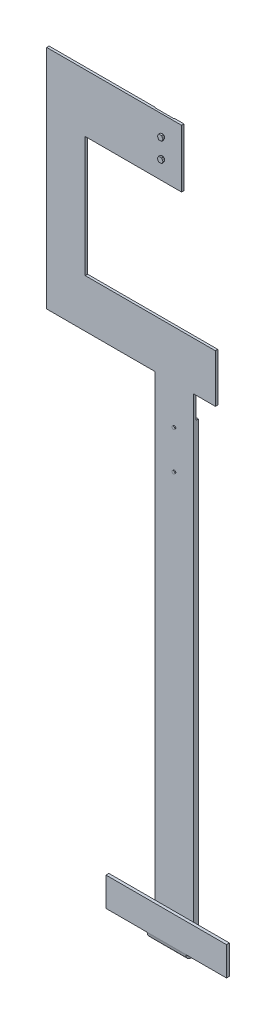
ISO-10303-21;
HEADER;
FILE_DESCRIPTION(('STEP AP214'),'2;1');
FILE_NAME('part.step','',(''),(''),'','','');
FILE_SCHEMA(('AUTOMOTIVE_DESIGN { 1 0 10303 214 1 1 1 1 }'));
ENDSEC;
DATA;
#1=APPLICATION_CONTEXT('core data for automotive mechanical design processes');
#2=APPLICATION_PROTOCOL_DEFINITION('international standard','automotive_design',2000,#1);
#3=PRODUCT_CONTEXT('',#1,'mechanical');
#4=PRODUCT('Part','Part','',(#3));
#5=PRODUCT_RELATED_PRODUCT_CATEGORY('part','',(#4));
#6=PRODUCT_DEFINITION_FORMATION('','',#4);
#7=PRODUCT_DEFINITION_CONTEXT('part definition',#1,'design');
#8=PRODUCT_DEFINITION('design','',#6,#7);
#9=PRODUCT_DEFINITION_SHAPE('','',#8);
#10=(LENGTH_UNIT() NAMED_UNIT(*) SI_UNIT(.MILLI.,.METRE.));
#11=(NAMED_UNIT(*) PLANE_ANGLE_UNIT() SI_UNIT($,.RADIAN.));
#12=(NAMED_UNIT(*) SI_UNIT($,.STERADIAN.) SOLID_ANGLE_UNIT());
#13=UNCERTAINTY_MEASURE_WITH_UNIT(LENGTH_MEASURE(1.E-05),#10,'distance_accuracy_value','');
#14=(GEOMETRIC_REPRESENTATION_CONTEXT(3) GLOBAL_UNCERTAINTY_ASSIGNED_CONTEXT((#13)) GLOBAL_UNIT_ASSIGNED_CONTEXT((#10,
#11,#12)) REPRESENTATION_CONTEXT('',''));
#15=CARTESIAN_POINT('',(0.,0.,0.));
#16=DIRECTION('',(0.,0.,1.));
#17=DIRECTION('',(1.,0.,0.));
#18=AXIS2_PLACEMENT_3D('',#15,#16,#17);
#19=CARTESIAN_POINT('',(-115.379048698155,-825.917078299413,22.));
#20=DIRECTION('',(0.,1.,0.));
#21=DIRECTION('',(0.,0.,1.));
#22=AXIS2_PLACEMENT_3D('',#19,#20,#21);
#23=PLANE('',#22);
#24=DIRECTION('',(1.,0.,0.));
#25=VECTOR('',#24,1.);
#26=CARTESIAN_POINT('',(-115.379048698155,-825.917078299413,16.));
#27=LINE('',#26,#25);
#28=CARTESIAN_POINT('',(-115.379048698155,-825.917078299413,16.));
#29=VERTEX_POINT('',#28);
#30=CARTESIAN_POINT('',(134.620951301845,-825.917078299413,16.));
#31=VERTEX_POINT('',#30);
#32=EDGE_CURVE('E589',#29,#31,#27,.T.);
#33=ORIENTED_EDGE('',*,*,#32,.T.);
#34=DIRECTION('',(0.,0.,-1.));
#35=VECTOR('',#34,1.);
#36=CARTESIAN_POINT('',(134.620951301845,-825.917078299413,22.));
#37=LINE('',#36,#35);
#38=CARTESIAN_POINT('',(134.620951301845,-825.917078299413,22.));
#39=VERTEX_POINT('',#38);
#40=EDGE_CURVE('E599',#39,#31,#37,.T.);
#41=ORIENTED_EDGE('',*,*,#40,.F.);
#42=DIRECTION('',(1.,0.,0.));
#43=VECTOR('',#42,1.);
#44=CARTESIAN_POINT('',(-115.379048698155,-825.917078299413,22.));
#45=LINE('',#44,#43);
#46=CARTESIAN_POINT('',(-115.379048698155,-825.917078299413,22.));
#47=VERTEX_POINT('',#46);
#48=EDGE_CURVE('E579',#47,#39,#45,.T.);
#49=ORIENTED_EDGE('',*,*,#48,.F.);
#50=DIRECTION('',(0.,0.,-1.));
#51=VECTOR('',#50,1.);
#52=CARTESIAN_POINT('',(-115.379048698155,-825.917078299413,22.));
#53=LINE('',#52,#51);
#54=EDGE_CURVE('E602',#47,#29,#53,.T.);
#55=ORIENTED_EDGE('',*,*,#54,.T.);
#56=EDGE_LOOP('',(#33,#41,#49,#55));
#57=FACE_BOUND('',#56,.T.);
#58=DIRECTION('',(0.,0.,1.));
#59=VECTOR('',#58,1.);
#60=CARTESIAN_POINT('',(49.6209513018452,-825.917078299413,22.));
#61=LINE('',#60,#59);
#62=CARTESIAN_POINT('',(49.6209513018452,-825.917078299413,16.3607396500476));
#63=VERTEX_POINT('',#62);
#64=CARTESIAN_POINT('',(49.6209513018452,-825.917078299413,21.3607396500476));
#65=VERTEX_POINT('',#64);
#66=EDGE_CURVE('E11',#63,#65,#61,.T.);
#67=ORIENTED_EDGE('',*,*,#66,.F.);
#68=DIRECTION('',(1.,0.,0.));
#69=VECTOR('',#68,1.);
#70=CARTESIAN_POINT('',(-115.379048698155,-825.917078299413,16.3607396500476));
#71=LINE('',#70,#69);
#72=CARTESIAN_POINT('',(-30.3790486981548,-825.917078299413,16.3607396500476));
#73=VERTEX_POINT('',#72);
#74=EDGE_CURVE('E43',#73,#63,#71,.T.);
#75=ORIENTED_EDGE('',*,*,#74,.F.);
#76=DIRECTION('',(0.,0.,-1.));
#77=VECTOR('',#76,1.);
#78=CARTESIAN_POINT('',(-30.3790486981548,-825.917078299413,22.));
#79=LINE('',#78,#77);
#80=CARTESIAN_POINT('',(-30.3790486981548,-825.917078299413,21.3607396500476));
#81=VERTEX_POINT('',#80);
#82=EDGE_CURVE('E608',#81,#73,#79,.T.);
#83=ORIENTED_EDGE('',*,*,#82,.F.);
#84=DIRECTION('',(-1.,0.,0.));
#85=VECTOR('',#84,1.);
#86=CARTESIAN_POINT('',(-115.379048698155,-825.917078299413,21.3607396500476));
#87=LINE('',#86,#85);
#88=EDGE_CURVE('E605',#65,#81,#87,.T.);
#89=ORIENTED_EDGE('',*,*,#88,.F.);
#90=EDGE_LOOP('',(#67,#75,#83,#89));
#91=FACE_BOUND('',#90,.T.);
#92=ADVANCED_FACE('F35',(#57,#91),#23,.F.);
#93=CARTESIAN_POINT('',(-115.379048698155,-765.917078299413,22.));
#94=DIRECTION('',(1.,0.,0.));
#95=DIRECTION('',(0.,1.,0.));
#96=AXIS2_PLACEMENT_3D('',#93,#94,#95);
#97=PLANE('',#96);
#98=DIRECTION('',(0.,-1.,0.));
#99=VECTOR('',#98,1.);
#100=CARTESIAN_POINT('',(-115.379048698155,-765.917078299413,16.));
#101=LINE('',#100,#99);
#102=CARTESIAN_POINT('',(-115.379048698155,-765.917078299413,16.));
#103=VERTEX_POINT('',#102);
#104=EDGE_CURVE('E575',#103,#29,#101,.T.);
#105=ORIENTED_EDGE('',*,*,#104,.T.);
#106=ORIENTED_EDGE('',*,*,#54,.F.);
#107=DIRECTION('',(0.,-1.,0.));
#108=VECTOR('',#107,1.);
#109=CARTESIAN_POINT('',(-115.379048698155,-765.917078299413,22.));
#110=LINE('',#109,#108);
#111=CARTESIAN_POINT('',(-115.379048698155,-765.917078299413,22.));
#112=VERTEX_POINT('',#111);
#113=EDGE_CURVE('E576',#112,#47,#110,.T.);
#114=ORIENTED_EDGE('',*,*,#113,.F.);
#115=DIRECTION('',(0.,0.,-1.));
#116=VECTOR('',#115,1.);
#117=CARTESIAN_POINT('',(-115.379048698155,-765.917078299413,22.));
#118=LINE('',#117,#116);
#119=EDGE_CURVE('E586',#112,#103,#118,.T.);
#120=ORIENTED_EDGE('',*,*,#119,.T.);
#121=EDGE_LOOP('',(#105,#106,#114,#120));
#122=FACE_BOUND('',#121,.T.);
#123=ADVANCED_FACE('F37',(#122),#97,.F.);
#124=CARTESIAN_POINT('',(134.620951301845,-765.917078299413,22.));
#125=DIRECTION('',(-1.,0.,0.));
#126=DIRECTION('',(0.,0.,1.));
#127=AXIS2_PLACEMENT_3D('',#124,#125,#126);
#128=PLANE('',#127);
#129=DIRECTION('',(0.,1.,0.));
#130=VECTOR('',#129,1.);
#131=CARTESIAN_POINT('',(134.620951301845,-765.917078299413,16.));
#132=LINE('',#131,#130);
#133=CARTESIAN_POINT('',(134.620951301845,-765.917078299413,16.));
#134=VERTEX_POINT('',#133);
#135=EDGE_CURVE('E591',#31,#134,#132,.T.);
#136=ORIENTED_EDGE('',*,*,#135,.T.);
#137=DIRECTION('',(0.,0.,-1.));
#138=VECTOR('',#137,1.);
#139=CARTESIAN_POINT('',(134.620951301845,-765.917078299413,22.));
#140=LINE('',#139,#138);
#141=CARTESIAN_POINT('',(134.620951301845,-765.917078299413,22.));
#142=VERTEX_POINT('',#141);
#143=EDGE_CURVE('E596',#142,#134,#140,.T.);
#144=ORIENTED_EDGE('',*,*,#143,.F.);
#145=DIRECTION('',(0.,1.,0.));
#146=VECTOR('',#145,1.);
#147=CARTESIAN_POINT('',(134.620951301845,-765.917078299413,22.));
#148=LINE('',#147,#146);
#149=EDGE_CURVE('E582',#39,#142,#148,.T.);
#150=ORIENTED_EDGE('',*,*,#149,.F.);
#151=ORIENTED_EDGE('',*,*,#40,.T.);
#152=EDGE_LOOP('',(#136,#144,#150,#151));
#153=FACE_BOUND('',#152,.T.);
#154=ADVANCED_FACE('F697',(#153),#128,.F.);
#155=CARTESIAN_POINT('',(-115.379048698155,-765.917078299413,22.));
#156=DIRECTION('',(0.,-1.,0.));
#157=DIRECTION('',(0.,0.,-1.));
#158=AXIS2_PLACEMENT_3D('',#155,#156,#157);
#159=PLANE('',#158);
#160=DIRECTION('',(-1.,0.,0.));
#161=VECTOR('',#160,1.);
#162=CARTESIAN_POINT('',(-115.379048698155,-765.917078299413,16.));
#163=LINE('',#162,#161);
#164=EDGE_CURVE('E580',#134,#103,#163,.T.);
#165=ORIENTED_EDGE('',*,*,#164,.T.);
#166=ORIENTED_EDGE('',*,*,#119,.F.);
#167=DIRECTION('',(-1.,0.,0.));
#168=VECTOR('',#167,1.);
#169=CARTESIAN_POINT('',(-115.379048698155,-765.917078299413,22.));
#170=LINE('',#169,#168);
#171=EDGE_CURVE('E584',#142,#112,#170,.T.);
#172=ORIENTED_EDGE('',*,*,#171,.F.);
#173=ORIENTED_EDGE('',*,*,#143,.T.);
#174=EDGE_LOOP('',(#165,#166,#172,#173));
#175=FACE_BOUND('',#174,.T.);
#176=ADVANCED_FACE('F702',(#175),#159,.F.);
#177=CARTESIAN_POINT('',(0.,0.,22.));
#178=DIRECTION('',(0.,0.,1.));
#179=DIRECTION('',(1.,0.,0.));
#180=AXIS2_PLACEMENT_3D('',#177,#178,#179);
#181=PLANE('',#180);
#182=ORIENTED_EDGE('',*,*,#113,.T.);
#183=ORIENTED_EDGE('',*,*,#48,.T.);
#184=ORIENTED_EDGE('',*,*,#149,.T.);
#185=ORIENTED_EDGE('',*,*,#171,.T.);
#186=EDGE_LOOP('',(#182,#183,#184,#185));
#187=FACE_BOUND('',#186,.T.);
#188=ADVANCED_FACE('F706',(#187),#181,.T.);
#189=CARTESIAN_POINT('',(0.,0.,16.));
#190=DIRECTION('',(0.,0.,1.));
#191=DIRECTION('',(1.,0.,0.));
#192=AXIS2_PLACEMENT_3D('',#189,#190,#191);
#193=PLANE('',#192);
#194=ORIENTED_EDGE('',*,*,#104,.F.);
#195=ORIENTED_EDGE('',*,*,#164,.F.);
#196=ORIENTED_EDGE('',*,*,#135,.F.);
#197=ORIENTED_EDGE('',*,*,#32,.F.);
#198=EDGE_LOOP('',(#194,#195,#196,#197));
#199=FACE_BOUND('',#198,.T.);
#200=ADVANCED_FACE('F708',(#199),#193,.F.);
#201=CARTESIAN_POINT('',(49.6209513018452,-825.468481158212,21.3607396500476));
#202=DIRECTION('',(-1.,0.,0.));
#203=DIRECTION('',(0.,0.,1.));
#204=AXIS2_PLACEMENT_3D('',#201,#202,#203);
#205=PLANE('',#204);
#206=DIRECTION('',(0.,-1.,0.));
#207=VECTOR('',#206,1.);
#208=CARTESIAN_POINT('',(49.6209513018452,-825.468481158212,16.3607396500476));
#209=LINE('',#208,#207);
#210=CARTESIAN_POINT('',(49.6209513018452,-827.468481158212,16.3607396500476));
#211=VERTEX_POINT('',#210);
#212=EDGE_CURVE('E572',#63,#211,#209,.T.);
#213=ORIENTED_EDGE('',*,*,#212,.F.);
#214=ORIENTED_EDGE('',*,*,#66,.T.);
#215=DIRECTION('',(0.,-1.,0.));
#216=VECTOR('',#215,1.);
#217=CARTESIAN_POINT('',(49.6209513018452,-825.468481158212,21.3607396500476));
#218=LINE('',#217,#216);
#219=CARTESIAN_POINT('',(49.6209513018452,-827.468481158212,21.3607396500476));
#220=VERTEX_POINT('',#219);
#221=EDGE_CURVE('E563',#65,#220,#218,.T.);
#222=ORIENTED_EDGE('',*,*,#221,.T.);
#223=CARTESIAN_POINT('',(49.6209513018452,-827.468481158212,10.6803698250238));
#224=DIRECTION('',(1.,0.,0.));
#225=DIRECTION('',(0.,0.,-1.));
#226=AXIS2_PLACEMENT_3D('',#223,#224,#225);
#227=CIRCLE('',#226,10.6803698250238);
#228=CARTESIAN_POINT('',(49.6209513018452,-827.468481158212,0.));
#229=VERTEX_POINT('',#228);
#230=EDGE_CURVE('E326',#220,#229,#227,.T.);
#231=ORIENTED_EDGE('',*,*,#230,.T.);
#232=DIRECTION('',(0.,0.,1.));
#233=VECTOR('',#232,1.);
#234=CARTESIAN_POINT('',(49.6209513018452,-827.468481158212,-5.));
#235=LINE('',#234,#233);
#236=CARTESIAN_POINT('',(49.6209513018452,-827.468481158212,-5.));
#237=VERTEX_POINT('',#236);
#238=EDGE_CURVE('E307',#237,#229,#235,.T.);
#239=ORIENTED_EDGE('',*,*,#238,.F.);
#240=DIRECTION('',(0.,1.,0.));
#241=VECTOR('',#240,1.);
#242=CARTESIAN_POINT('',(49.6209513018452,-827.468481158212,-5.));
#243=LINE('',#242,#241);
#244=CARTESIAN_POINT('',(49.6209513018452,122.531518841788,-5.));
#245=VERTEX_POINT('',#244);
#246=EDGE_CURVE('E299',#237,#245,#243,.T.);
#247=ORIENTED_EDGE('',*,*,#246,.T.);
#248=DIRECTION('',(0.,0.,1.));
#249=VECTOR('',#248,1.);
#250=CARTESIAN_POINT('',(49.6209513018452,122.531518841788,-5.));
#251=LINE('',#250,#249);
#252=CARTESIAN_POINT('',(49.6209513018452,122.531518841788,0.));
#253=VERTEX_POINT('',#252);
#254=EDGE_CURVE('E281',#245,#253,#251,.T.);
#255=ORIENTED_EDGE('',*,*,#254,.T.);
#256=DIRECTION('',(0.,-1.,0.));
#257=VECTOR('',#256,1.);
#258=CARTESIAN_POINT('',(49.6209513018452,0.,0.));
#259=LINE('',#258,#257);
#260=CARTESIAN_POINT('',(49.6209513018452,172.531518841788,0.));
#261=VERTEX_POINT('',#260);
#262=EDGE_CURVE('E520',#261,#253,#259,.T.);
#263=ORIENTED_EDGE('',*,*,#262,.F.);
#264=DIRECTION('',(0.,0.,-1.));
#265=VECTOR('',#264,1.);
#266=CARTESIAN_POINT('',(49.6209513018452,172.531518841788,5.));
#267=LINE('',#266,#265);
#268=CARTESIAN_POINT('',(49.6209513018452,172.531518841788,5.));
#269=VERTEX_POINT('',#268);
#270=EDGE_CURVE('E540',#269,#261,#267,.T.);
#271=ORIENTED_EDGE('',*,*,#270,.F.);
#272=DIRECTION('',(0.,-1.,0.));
#273=VECTOR('',#272,1.);
#274=CARTESIAN_POINT('',(49.6209513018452,0.,5.));
#275=LINE('',#274,#273);
#276=CARTESIAN_POINT('',(49.6209513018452,-827.468481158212,5.));
#277=VERTEX_POINT('',#276);
#278=EDGE_CURVE('E490',#269,#277,#275,.T.);
#279=ORIENTED_EDGE('',*,*,#278,.T.);
#280=CARTESIAN_POINT('',(49.6209513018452,-827.468481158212,10.6803698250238));
#281=DIRECTION('',(1.,0.,0.));
#282=DIRECTION('',(0.,0.,-1.));
#283=AXIS2_PLACEMENT_3D('',#280,#281,#282);
#284=CIRCLE('',#283,5.6803698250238);
#285=EDGE_CURVE('E323',#211,#277,#284,.T.);
#286=ORIENTED_EDGE('',*,*,#285,.F.);
#287=EDGE_LOOP('',(#213,#214,#222,#231,#239,#247,#255,#263,#271,#279,#286));
#288=FACE_BOUND('',#287,.T.);
#289=ADVANCED_FACE('F305',(#288),#205,.F.);
#290=CARTESIAN_POINT('',(49.6209513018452,-825.468481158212,16.3607396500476));
#291=DIRECTION('',(0.,0.,1.));
#292=DIRECTION('',(0.,-1.,0.));
#293=AXIS2_PLACEMENT_3D('',#290,#291,#292);
#294=PLANE('',#293);
#295=DIRECTION('',(0.,-1.,0.));
#296=VECTOR('',#295,1.);
#297=CARTESIAN_POINT('',(-30.3790486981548,-825.468481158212,16.3607396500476));
#298=LINE('',#297,#296);
#299=CARTESIAN_POINT('',(-30.3790486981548,-827.468481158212,16.3607396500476));
#300=VERTEX_POINT('',#299);
#301=EDGE_CURVE('E569',#73,#300,#298,.T.);
#302=ORIENTED_EDGE('',*,*,#301,.F.);
#303=ORIENTED_EDGE('',*,*,#74,.T.);
#304=ORIENTED_EDGE('',*,*,#212,.T.);
#305=DIRECTION('',(-1.,0.,0.));
#306=VECTOR('',#305,1.);
#307=CARTESIAN_POINT('',(49.6209513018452,-827.468481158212,16.3607396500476));
#308=LINE('',#307,#306);
#309=EDGE_CURVE('E435',#211,#300,#308,.T.);
#310=ORIENTED_EDGE('',*,*,#309,.T.);
#311=EDGE_LOOP('',(#302,#303,#304,#310));
#312=FACE_BOUND('',#311,.T.);
#313=ADVANCED_FACE('F611',(#312),#294,.F.);
#314=CARTESIAN_POINT('',(-30.3790486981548,-825.468481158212,21.3607396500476));
#315=DIRECTION('',(1.,0.,0.));
#316=DIRECTION('',(0.,0.,-1.));
#317=AXIS2_PLACEMENT_3D('',#314,#315,#316);
#318=PLANE('',#317);
#319=DIRECTION('',(0.,-1.,0.));
#320=VECTOR('',#319,1.);
#321=CARTESIAN_POINT('',(-30.3790486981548,-825.468481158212,21.3607396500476));
#322=LINE('',#321,#320);
#323=CARTESIAN_POINT('',(-30.3790486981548,-827.468481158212,21.3607396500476));
#324=VERTEX_POINT('',#323);
#325=EDGE_CURVE('E566',#81,#324,#322,.T.);
#326=ORIENTED_EDGE('',*,*,#325,.F.);
#327=ORIENTED_EDGE('',*,*,#82,.T.);
#328=ORIENTED_EDGE('',*,*,#301,.T.);
#329=CARTESIAN_POINT('',(-30.3790486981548,-827.468481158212,10.6803698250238));
#330=DIRECTION('',(1.,0.,0.));
#331=DIRECTION('',(0.,0.,-1.));
#332=AXIS2_PLACEMENT_3D('',#329,#330,#331);
#333=CIRCLE('',#332,5.6803698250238);
#334=CARTESIAN_POINT('',(-30.3790486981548,-827.468481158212,5.));
#335=VERTEX_POINT('',#334);
#336=EDGE_CURVE('E317',#300,#335,#333,.T.);
#337=ORIENTED_EDGE('',*,*,#336,.T.);
#338=DIRECTION('',(0.,-1.,0.));
#339=VECTOR('',#338,1.);
#340=CARTESIAN_POINT('',(-30.3790486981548,0.,5.));
#341=LINE('',#340,#339);
#342=CARTESIAN_POINT('',(-30.3790486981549,172.531518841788,5.));
#343=VERTEX_POINT('',#342);
#344=EDGE_CURVE('E488',#343,#335,#341,.T.);
#345=ORIENTED_EDGE('',*,*,#344,.F.);
#346=DIRECTION('',(0.,0.,-1.));
#347=VECTOR('',#346,1.);
#348=CARTESIAN_POINT('',(-30.3790486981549,172.531518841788,5.));
#349=LINE('',#348,#347);
#350=CARTESIAN_POINT('',(-30.3790486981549,172.531518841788,0.));
#351=VERTEX_POINT('',#350);
#352=EDGE_CURVE('E542',#343,#351,#349,.T.);
#353=ORIENTED_EDGE('',*,*,#352,.T.);
#354=DIRECTION('',(0.,-1.,0.));
#355=VECTOR('',#354,1.);
#356=CARTESIAN_POINT('',(-30.3790486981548,0.,0.));
#357=LINE('',#356,#355);
#358=CARTESIAN_POINT('',(-30.3790486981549,122.531518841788,0.));
#359=VERTEX_POINT('',#358);
#360=EDGE_CURVE('E517',#351,#359,#357,.T.);
#361=ORIENTED_EDGE('',*,*,#360,.T.);
#362=DIRECTION('',(0.,0.,1.));
#363=VECTOR('',#362,1.);
#364=CARTESIAN_POINT('',(-30.3790486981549,122.531518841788,-5.));
#365=LINE('',#364,#363);
#366=CARTESIAN_POINT('',(-30.3790486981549,122.531518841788,-5.));
#367=VERTEX_POINT('',#366);
#368=EDGE_CURVE('E291',#367,#359,#365,.T.);
#369=ORIENTED_EDGE('',*,*,#368,.F.);
#370=DIRECTION('',(0.,-1.,0.));
#371=VECTOR('',#370,1.);
#372=CARTESIAN_POINT('',(-30.3790486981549,-827.468481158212,-5.));
#373=LINE('',#372,#371);
#374=CARTESIAN_POINT('',(-30.3790486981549,-827.468481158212,-5.));
#375=VERTEX_POINT('',#374);
#376=EDGE_CURVE('E302',#367,#375,#373,.T.);
#377=ORIENTED_EDGE('',*,*,#376,.T.);
#378=DIRECTION('',(0.,0.,1.));
#379=VECTOR('',#378,1.);
#380=CARTESIAN_POINT('',(-30.3790486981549,-827.468481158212,-5.));
#381=LINE('',#380,#379);
#382=CARTESIAN_POINT('',(-30.3790486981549,-827.468481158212,0.));
#383=VERTEX_POINT('',#382);
#384=EDGE_CURVE('E318',#375,#383,#381,.T.);
#385=ORIENTED_EDGE('',*,*,#384,.T.);
#386=CARTESIAN_POINT('',(-30.3790486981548,-827.468481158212,10.6803698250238));
#387=DIRECTION('',(1.,0.,0.));
#388=DIRECTION('',(0.,0.,-1.));
#389=AXIS2_PLACEMENT_3D('',#386,#387,#388);
#390=CIRCLE('',#389,10.6803698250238);
#391=EDGE_CURVE('E328',#324,#383,#390,.T.);
#392=ORIENTED_EDGE('',*,*,#391,.F.);
#393=EDGE_LOOP('',(#326,#327,#328,#337,#345,#353,#361,#369,#377,#385,#392));
#394=FACE_BOUND('',#393,.T.);
#395=ADVANCED_FACE('F621',(#394),#318,.F.);
#396=CARTESIAN_POINT('',(49.6209513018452,-825.468481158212,21.3607396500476));
#397=DIRECTION('',(0.,0.,-1.));
#398=DIRECTION('',(0.,1.,0.));
#399=AXIS2_PLACEMENT_3D('',#396,#397,#398);
#400=PLANE('',#399);
#401=ORIENTED_EDGE('',*,*,#221,.F.);
#402=ORIENTED_EDGE('',*,*,#88,.T.);
#403=ORIENTED_EDGE('',*,*,#325,.T.);
#404=DIRECTION('',(1.,0.,0.));
#405=VECTOR('',#404,1.);
#406=CARTESIAN_POINT('',(49.6209513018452,-827.468481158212,21.3607396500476));
#407=LINE('',#406,#405);
#408=EDGE_CURVE('E560',#324,#220,#407,.T.);
#409=ORIENTED_EDGE('',*,*,#408,.T.);
#410=EDGE_LOOP('',(#401,#402,#403,#409));
#411=FACE_BOUND('',#410,.T.);
#412=ADVANCED_FACE('F623',(#411),#400,.F.);
#413=CARTESIAN_POINT('',(0.,0.,0.));
#414=DIRECTION('',(0.,0.,1.));
#415=DIRECTION('',(1.,0.,0.));
#416=AXIS2_PLACEMENT_3D('',#413,#414,#415);
#417=PLANE('',#416);
#418=DIRECTION('',(1.,0.,0.));
#419=VECTOR('',#418,1.);
#420=CARTESIAN_POINT('',(0.,522.531518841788,0.));
#421=LINE('',#420,#419);
#422=CARTESIAN_POINT('',(4.62095130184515,522.531518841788,0.));
#423=VERTEX_POINT('',#422);
#424=CARTESIAN_POINT('',(24.6209513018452,522.531518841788,0.));
#425=VERTEX_POINT('',#424);
#426=EDGE_CURVE('E465',#423,#425,#421,.T.);
#427=ORIENTED_EDGE('',*,*,#426,.F.);
#428=DIRECTION('',(0.,-1.,0.));
#429=VECTOR('',#428,1.);
#430=CARTESIAN_POINT('',(4.62095130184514,642.531518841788,0.));
#431=LINE('',#430,#429);
#432=CARTESIAN_POINT('',(4.62095130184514,642.531518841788,0.));
#433=VERTEX_POINT('',#432);
#434=EDGE_CURVE('E442',#433,#423,#431,.T.);
#435=ORIENTED_EDGE('',*,*,#434,.F.);
#436=DIRECTION('',(1.,0.,0.));
#437=VECTOR('',#436,1.);
#438=CARTESIAN_POINT('',(0.,642.531518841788,0.));
#439=LINE('',#438,#437);
#440=CARTESIAN_POINT('',(24.6209513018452,642.531518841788,0.));
#441=VERTEX_POINT('',#440);
#442=EDGE_CURVE('E507',#433,#441,#439,.T.);
#443=ORIENTED_EDGE('',*,*,#442,.T.);
#444=DIRECTION('',(0.,1.,0.));
#445=VECTOR('',#444,1.);
#446=CARTESIAN_POINT('',(24.6209513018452,0.,0.));
#447=LINE('',#446,#445);
#448=EDGE_CURVE('E504',#425,#441,#447,.T.);
#449=ORIENTED_EDGE('',*,*,#448,.F.);
#450=EDGE_LOOP('',(#427,#435,#443,#449));
#451=FACE_BOUND('',#450,.T.);
#452=ADVANCED_FACE('F723',(#451),#417,.F.);
#453=CARTESIAN_POINT('',(0.,522.531518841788,5.));
#454=DIRECTION('',(0.,1.,0.));
#455=DIRECTION('',(0.,0.,1.));
#456=AXIS2_PLACEMENT_3D('',#453,#454,#455);
#457=PLANE('',#456);
#458=DIRECTION('',(-1.,0.,0.));
#459=VECTOR('',#458,1.);
#460=CARTESIAN_POINT('',(4.62095130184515,522.531518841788,1.));
#461=LINE('',#460,#459);
#462=CARTESIAN_POINT('',(4.62095130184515,522.531518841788,1.));
#463=VERTEX_POINT('',#462);
#464=CARTESIAN_POINT('',(-35.3790486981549,522.531518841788,1.));
#465=VERTEX_POINT('',#464);
#466=EDGE_CURVE('E450',#463,#465,#461,.T.);
#467=ORIENTED_EDGE('',*,*,#466,.F.);
#468=DIRECTION('',(0.,0.,-1.));
#469=VECTOR('',#468,1.);
#470=CARTESIAN_POINT('',(4.62095130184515,522.531518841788,1.));
#471=LINE('',#470,#469);
#472=EDGE_CURVE('E460',#463,#423,#471,.T.);
#473=ORIENTED_EDGE('',*,*,#472,.T.);
#474=ORIENTED_EDGE('',*,*,#426,.T.);
#475=DIRECTION('',(0.,0.,-1.));
#476=VECTOR('',#475,1.);
#477=CARTESIAN_POINT('',(24.6209513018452,522.531518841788,5.));
#478=LINE('',#477,#476);
#479=CARTESIAN_POINT('',(24.6209513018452,522.531518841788,5.));
#480=VERTEX_POINT('',#479);
#481=EDGE_CURVE('E551',#480,#425,#478,.T.);
#482=ORIENTED_EDGE('',*,*,#481,.F.);
#483=DIRECTION('',(1.,0.,0.));
#484=VECTOR('',#483,1.);
#485=CARTESIAN_POINT('',(0.,522.531518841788,5.));
#486=LINE('',#485,#484);
#487=CARTESIAN_POINT('',(-175.379048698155,522.531518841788,5.));
#488=VERTEX_POINT('',#487);
#489=EDGE_CURVE('E473',#488,#480,#486,.T.);
#490=ORIENTED_EDGE('',*,*,#489,.F.);
#491=DIRECTION('',(0.,0.,-1.));
#492=VECTOR('',#491,1.);
#493=CARTESIAN_POINT('',(-175.379048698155,522.531518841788,5.));
#494=LINE('',#493,#492);
#495=CARTESIAN_POINT('',(-175.379048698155,522.531518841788,0.));
#496=VERTEX_POINT('',#495);
#497=EDGE_CURVE('E500',#488,#496,#494,.T.);
#498=ORIENTED_EDGE('',*,*,#497,.T.);
#499=CARTESIAN_POINT('',(-35.3790486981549,522.531518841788,0.));
#500=VERTEX_POINT('',#499);
#501=EDGE_CURVE('E501',#496,#500,#421,.T.);
#502=ORIENTED_EDGE('',*,*,#501,.T.);
#503=DIRECTION('',(0.,0.,-1.));
#504=VECTOR('',#503,1.);
#505=CARTESIAN_POINT('',(-35.3790486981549,522.531518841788,1.));
#506=LINE('',#505,#504);
#507=EDGE_CURVE('E469',#465,#500,#506,.T.);
#508=ORIENTED_EDGE('',*,*,#507,.F.);
#509=EDGE_LOOP('',(#467,#473,#474,#482,#490,#498,#502,#508));
#510=FACE_BOUND('',#509,.T.);
#511=ADVANCED_FACE('F664',(#510),#457,.F.);
#512=CARTESIAN_POINT('',(24.6209513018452,0.,5.));
#513=DIRECTION('',(-1.,0.,0.));
#514=DIRECTION('',(0.,0.,1.));
#515=AXIS2_PLACEMENT_3D('',#512,#513,#514);
#516=PLANE('',#515);
#517=ORIENTED_EDGE('',*,*,#448,.T.);
#518=DIRECTION('',(0.,0.,-1.));
#519=VECTOR('',#518,1.);
#520=CARTESIAN_POINT('',(24.6209513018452,642.531518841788,5.));
#521=LINE('',#520,#519);
#522=CARTESIAN_POINT('',(24.6209513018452,642.531518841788,5.));
#523=VERTEX_POINT('',#522);
#524=EDGE_CURVE('E548',#523,#441,#521,.T.);
#525=ORIENTED_EDGE('',*,*,#524,.F.);
#526=DIRECTION('',(0.,1.,0.));
#527=VECTOR('',#526,1.);
#528=CARTESIAN_POINT('',(24.6209513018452,0.,5.));
#529=LINE('',#528,#527);
#530=EDGE_CURVE('E476',#480,#523,#529,.T.);
#531=ORIENTED_EDGE('',*,*,#530,.F.);
#532=ORIENTED_EDGE('',*,*,#481,.T.);
#533=EDGE_LOOP('',(#517,#525,#531,#532));
#534=FACE_BOUND('',#533,.T.);
#535=ADVANCED_FACE('F726',(#534),#516,.F.);
#536=CARTESIAN_POINT('',(0.,642.531518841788,5.));
#537=DIRECTION('',(0.,1.,0.));
#538=DIRECTION('',(0.,0.,1.));
#539=AXIS2_PLACEMENT_3D('',#536,#537,#538);
#540=PLANE('',#539);
#541=DIRECTION('',(0.,0.,-1.));
#542=VECTOR('',#541,1.);
#543=CARTESIAN_POINT('',(4.62095130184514,642.531518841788,1.));
#544=LINE('',#543,#542);
#545=CARTESIAN_POINT('',(4.62095130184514,642.531518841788,1.));
#546=VERTEX_POINT('',#545);
#547=EDGE_CURVE('E463',#546,#433,#544,.T.);
#548=ORIENTED_EDGE('',*,*,#547,.F.);
#549=DIRECTION('',(1.,0.,0.));
#550=VECTOR('',#549,1.);
#551=CARTESIAN_POINT('',(4.62095130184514,642.531518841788,1.));
#552=LINE('',#551,#550);
#553=CARTESIAN_POINT('',(-35.3790486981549,642.531518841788,1.));
#554=VERTEX_POINT('',#553);
#555=EDGE_CURVE('E457',#554,#546,#552,.T.);
#556=ORIENTED_EDGE('',*,*,#555,.F.);
#557=DIRECTION('',(0.,0.,-1.));
#558=VECTOR('',#557,1.);
#559=CARTESIAN_POINT('',(-35.3790486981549,642.531518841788,1.));
#560=LINE('',#559,#558);
#561=CARTESIAN_POINT('',(-35.3790486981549,642.531518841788,0.));
#562=VERTEX_POINT('',#561);
#563=EDGE_CURVE('E466',#554,#562,#560,.T.);
#564=ORIENTED_EDGE('',*,*,#563,.T.);
#565=CARTESIAN_POINT('',(-255.379048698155,642.531518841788,0.));
#566=VERTEX_POINT('',#565);
#567=EDGE_CURVE('E508',#566,#562,#439,.T.);
#568=ORIENTED_EDGE('',*,*,#567,.F.);
#569=DIRECTION('',(0.,0.,-1.));
#570=VECTOR('',#569,1.);
#571=CARTESIAN_POINT('',(-255.379048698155,642.531518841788,5.));
#572=LINE('',#571,#570);
#573=CARTESIAN_POINT('',(-255.379048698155,642.531518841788,5.));
#574=VERTEX_POINT('',#573);
#575=EDGE_CURVE('E546',#574,#566,#572,.T.);
#576=ORIENTED_EDGE('',*,*,#575,.F.);
#577=DIRECTION('',(1.,0.,0.));
#578=VECTOR('',#577,1.);
#579=CARTESIAN_POINT('',(0.,642.531518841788,5.));
#580=LINE('',#579,#578);
#581=EDGE_CURVE('E479',#574,#523,#580,.T.);
#582=ORIENTED_EDGE('',*,*,#581,.T.);
#583=ORIENTED_EDGE('',*,*,#524,.T.);
#584=ORIENTED_EDGE('',*,*,#442,.F.);
#585=EDGE_LOOP('',(#548,#556,#564,#568,#576,#582,#583,#584));
#586=FACE_BOUND('',#585,.T.);
#587=ADVANCED_FACE('F655',(#586),#540,.T.);
#588=CARTESIAN_POINT('',(-255.379048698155,0.,5.));
#589=DIRECTION('',(-1.,0.,0.));
#590=DIRECTION('',(0.,0.,1.));
#591=AXIS2_PLACEMENT_3D('',#588,#589,#590);
#592=PLANE('',#591);
#593=DIRECTION('',(0.,1.,0.));
#594=VECTOR('',#593,1.);
#595=CARTESIAN_POINT('',(-255.379048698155,0.,0.));
#596=LINE('',#595,#594);
#597=CARTESIAN_POINT('',(-255.379048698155,172.531518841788,0.));
#598=VERTEX_POINT('',#597);
#599=EDGE_CURVE('E511',#598,#566,#596,.T.);
#600=ORIENTED_EDGE('',*,*,#599,.F.);
#601=DIRECTION('',(0.,0.,-1.));
#602=VECTOR('',#601,1.);
#603=CARTESIAN_POINT('',(-255.379048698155,172.531518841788,5.));
#604=LINE('',#603,#602);
#605=CARTESIAN_POINT('',(-255.379048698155,172.531518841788,5.));
#606=VERTEX_POINT('',#605);
#607=EDGE_CURVE('E544',#606,#598,#604,.T.);
#608=ORIENTED_EDGE('',*,*,#607,.F.);
#609=DIRECTION('',(0.,1.,0.));
#610=VECTOR('',#609,1.);
#611=CARTESIAN_POINT('',(-255.379048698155,0.,5.));
#612=LINE('',#611,#610);
#613=EDGE_CURVE('E482',#606,#574,#612,.T.);
#614=ORIENTED_EDGE('',*,*,#613,.T.);
#615=ORIENTED_EDGE('',*,*,#575,.T.);
#616=EDGE_LOOP('',(#600,#608,#614,#615));
#617=FACE_BOUND('',#616,.T.);
#618=ADVANCED_FACE('F651',(#617),#592,.T.);
#619=CARTESIAN_POINT('',(0.,172.531518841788,5.));
#620=DIRECTION('',(0.,-1.,0.));
#621=DIRECTION('',(1.,0.,0.));
#622=AXIS2_PLACEMENT_3D('',#619,#620,#621);
#623=PLANE('',#622);
#624=DIRECTION('',(-1.,0.,0.));
#625=VECTOR('',#624,1.);
#626=CARTESIAN_POINT('',(0.,172.531518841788,0.));
#627=LINE('',#626,#625);
#628=EDGE_CURVE('E514',#351,#598,#627,.T.);
#629=ORIENTED_EDGE('',*,*,#628,.F.);
#630=ORIENTED_EDGE('',*,*,#352,.F.);
#631=DIRECTION('',(-1.,0.,0.));
#632=VECTOR('',#631,1.);
#633=CARTESIAN_POINT('',(0.,172.531518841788,5.));
#634=LINE('',#633,#632);
#635=EDGE_CURVE('E485',#343,#606,#634,.T.);
#636=ORIENTED_EDGE('',*,*,#635,.T.);
#637=ORIENTED_EDGE('',*,*,#607,.T.);
#638=EDGE_LOOP('',(#629,#630,#636,#637));
#639=FACE_BOUND('',#638,.T.);
#640=ADVANCED_FACE('F646',(#639),#623,.T.);
#641=CARTESIAN_POINT('',(0.,172.531518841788,5.));
#642=DIRECTION('',(0.,1.,0.));
#643=DIRECTION('',(0.,0.,1.));
#644=AXIS2_PLACEMENT_3D('',#641,#642,#643);
#645=PLANE('',#644);
#646=DIRECTION('',(1.,0.,0.));
#647=VECTOR('',#646,1.);
#648=CARTESIAN_POINT('',(0.,172.531518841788,0.));
#649=LINE('',#648,#647);
#650=CARTESIAN_POINT('',(94.6209513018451,172.531518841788,0.));
#651=VERTEX_POINT('',#650);
#652=EDGE_CURVE('E522',#261,#651,#649,.T.);
#653=ORIENTED_EDGE('',*,*,#652,.T.);
#654=DIRECTION('',(0.,0.,-1.));
#655=VECTOR('',#654,1.);
#656=CARTESIAN_POINT('',(94.6209513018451,172.531518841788,5.));
#657=LINE('',#656,#655);
#658=CARTESIAN_POINT('',(94.6209513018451,172.531518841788,5.));
#659=VERTEX_POINT('',#658);
#660=EDGE_CURVE('E537',#659,#651,#657,.T.);
#661=ORIENTED_EDGE('',*,*,#660,.F.);
#662=DIRECTION('',(1.,0.,0.));
#663=VECTOR('',#662,1.);
#664=CARTESIAN_POINT('',(0.,172.531518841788,5.));
#665=LINE('',#664,#663);
#666=EDGE_CURVE('E492',#269,#659,#665,.T.);
#667=ORIENTED_EDGE('',*,*,#666,.F.);
#668=ORIENTED_EDGE('',*,*,#270,.T.);
#669=EDGE_LOOP('',(#653,#661,#667,#668));
#670=FACE_BOUND('',#669,.T.);
#671=ADVANCED_FACE('F639',(#670),#645,.F.);
#672=CARTESIAN_POINT('',(94.6209513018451,0.,5.));
#673=DIRECTION('',(-1.,0.,0.));
#674=DIRECTION('',(0.,0.,1.));
#675=AXIS2_PLACEMENT_3D('',#672,#673,#674);
#676=PLANE('',#675);
#677=DIRECTION('',(0.,1.,0.));
#678=VECTOR('',#677,1.);
#679=CARTESIAN_POINT('',(94.6209513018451,0.,0.));
#680=LINE('',#679,#678);
#681=CARTESIAN_POINT('',(94.6209513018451,272.531518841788,0.));
#682=VERTEX_POINT('',#681);
#683=EDGE_CURVE('E524',#651,#682,#680,.T.);
#684=ORIENTED_EDGE('',*,*,#683,.T.);
#685=DIRECTION('',(0.,0.,-1.));
#686=VECTOR('',#685,1.);
#687=CARTESIAN_POINT('',(94.6209513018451,272.531518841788,5.));
#688=LINE('',#687,#686);
#689=CARTESIAN_POINT('',(94.6209513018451,272.531518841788,5.));
#690=VERTEX_POINT('',#689);
#691=EDGE_CURVE('E534',#690,#682,#688,.T.);
#692=ORIENTED_EDGE('',*,*,#691,.F.);
#693=DIRECTION('',(0.,1.,0.));
#694=VECTOR('',#693,1.);
#695=CARTESIAN_POINT('',(94.6209513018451,0.,5.));
#696=LINE('',#695,#694);
#697=EDGE_CURVE('E494',#659,#690,#696,.T.);
#698=ORIENTED_EDGE('',*,*,#697,.F.);
#699=ORIENTED_EDGE('',*,*,#660,.T.);
#700=EDGE_LOOP('',(#684,#692,#698,#699));
#701=FACE_BOUND('',#700,.T.);
#702=ADVANCED_FACE('F681',(#701),#676,.F.);
#703=CARTESIAN_POINT('',(0.,272.531518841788,5.));
#704=DIRECTION('',(0.,-1.,0.));
#705=DIRECTION('',(1.,0.,0.));
#706=AXIS2_PLACEMENT_3D('',#703,#704,#705);
#707=PLANE('',#706);
#708=DIRECTION('',(-1.,0.,0.));
#709=VECTOR('',#708,1.);
#710=CARTESIAN_POINT('',(0.,272.531518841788,0.));
#711=LINE('',#710,#709);
#712=CARTESIAN_POINT('',(-175.379048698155,272.531518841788,0.));
#713=VERTEX_POINT('',#712);
#714=EDGE_CURVE('E526',#682,#713,#711,.T.);
#715=ORIENTED_EDGE('',*,*,#714,.T.);
#716=DIRECTION('',(0.,0.,-1.));
#717=VECTOR('',#716,1.);
#718=CARTESIAN_POINT('',(-175.379048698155,272.531518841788,5.));
#719=LINE('',#718,#717);
#720=CARTESIAN_POINT('',(-175.379048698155,272.531518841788,5.));
#721=VERTEX_POINT('',#720);
#722=EDGE_CURVE('E531',#721,#713,#719,.T.);
#723=ORIENTED_EDGE('',*,*,#722,.F.);
#724=DIRECTION('',(-1.,0.,0.));
#725=VECTOR('',#724,1.);
#726=CARTESIAN_POINT('',(0.,272.531518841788,5.));
#727=LINE('',#726,#725);
#728=EDGE_CURVE('E496',#690,#721,#727,.T.);
#729=ORIENTED_EDGE('',*,*,#728,.F.);
#730=ORIENTED_EDGE('',*,*,#691,.T.);
#731=EDGE_LOOP('',(#715,#723,#729,#730));
#732=FACE_BOUND('',#731,.T.);
#733=ADVANCED_FACE('F679',(#732),#707,.F.);
#734=CARTESIAN_POINT('',(-175.379048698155,0.,5.));
#735=DIRECTION('',(-1.,0.,0.));
#736=DIRECTION('',(0.,0.,1.));
#737=AXIS2_PLACEMENT_3D('',#734,#735,#736);
#738=PLANE('',#737);
#739=DIRECTION('',(0.,1.,0.));
#740=VECTOR('',#739,1.);
#741=CARTESIAN_POINT('',(-175.379048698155,0.,0.));
#742=LINE('',#741,#740);
#743=EDGE_CURVE('E477',#713,#496,#742,.T.);
#744=ORIENTED_EDGE('',*,*,#743,.T.);
#745=ORIENTED_EDGE('',*,*,#497,.F.);
#746=DIRECTION('',(0.,1.,0.));
#747=VECTOR('',#746,1.);
#748=CARTESIAN_POINT('',(-175.379048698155,0.,5.));
#749=LINE('',#748,#747);
#750=EDGE_CURVE('E498',#721,#488,#749,.T.);
#751=ORIENTED_EDGE('',*,*,#750,.F.);
#752=ORIENTED_EDGE('',*,*,#722,.T.);
#753=EDGE_LOOP('',(#744,#745,#751,#752));
#754=FACE_BOUND('',#753,.T.);
#755=ADVANCED_FACE('F670',(#754),#738,.F.);
#756=CARTESIAN_POINT('',(0.,0.,5.));
#757=DIRECTION('',(0.,0.,1.));
#758=DIRECTION('',(1.,0.,0.));
#759=AXIS2_PLACEMENT_3D('',#756,#757,#758);
#760=PLANE('',#759);
#761=CARTESIAN_POINT('',(9.62095130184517,12.5315188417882,5.));
#762=DIRECTION('',(0.,0.,1.));
#763=DIRECTION('',(1.,0.,0.));
#764=AXIS2_PLACEMENT_3D('',#761,#762,#763);
#765=CIRCLE('',#764,3.);
#766=CARTESIAN_POINT('',(12.6209513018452,12.5315188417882,5.));
#767=VERTEX_POINT('',#766);
#768=EDGE_CURVE('E1346',#767,#767,#765,.T.);
#769=ORIENTED_EDGE('',*,*,#768,.F.);
#770=EDGE_LOOP('',(#769));
#771=FACE_BOUND('',#770,.T.);
#772=CARTESIAN_POINT('',(9.62095130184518,92.5315188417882,5.));
#773=DIRECTION('',(0.,0.,1.));
#774=DIRECTION('',(1.,0.,0.));
#775=AXIS2_PLACEMENT_3D('',#772,#773,#774);
#776=CIRCLE('',#775,3.);
#777=CARTESIAN_POINT('',(12.6209513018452,92.5315188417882,5.));
#778=VERTEX_POINT('',#777);
#779=EDGE_CURVE('E309',#778,#778,#776,.T.);
#780=ORIENTED_EDGE('',*,*,#779,.F.);
#781=EDGE_LOOP('',(#780));
#782=FACE_BOUND('',#781,.T.);
#783=CARTESIAN_POINT('',(-15.3790486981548,602.531518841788,5.));
#784=DIRECTION('',(0.,0.,1.));
#785=DIRECTION('',(1.,0.,0.));
#786=AXIS2_PLACEMENT_3D('',#783,#784,#785);
#787=CIRCLE('',#786,5.);
#788=CARTESIAN_POINT('',(-10.3790486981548,602.531518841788,5.));
#789=VERTEX_POINT('',#788);
#790=EDGE_CURVE('E432',#789,#789,#787,.T.);
#791=ORIENTED_EDGE('',*,*,#790,.F.);
#792=EDGE_LOOP('',(#791));
#793=FACE_BOUND('',#792,.T.);
#794=CARTESIAN_POINT('',(-15.3790486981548,562.531518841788,5.));
#795=DIRECTION('',(0.,0.,1.));
#796=DIRECTION('',(1.,0.,0.));
#797=AXIS2_PLACEMENT_3D('',#794,#795,#796);
#798=CIRCLE('',#797,5.);
#799=CARTESIAN_POINT('',(-10.3790486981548,562.531518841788,5.));
#800=VERTEX_POINT('',#799);
#801=EDGE_CURVE('E443',#800,#800,#798,.T.);
#802=ORIENTED_EDGE('',*,*,#801,.F.);
#803=EDGE_LOOP('',(#802));
#804=FACE_BOUND('',#803,.T.);
#805=ORIENTED_EDGE('',*,*,#489,.T.);
#806=ORIENTED_EDGE('',*,*,#530,.T.);
#807=ORIENTED_EDGE('',*,*,#581,.F.);
#808=ORIENTED_EDGE('',*,*,#613,.F.);
#809=ORIENTED_EDGE('',*,*,#635,.F.);
#810=ORIENTED_EDGE('',*,*,#344,.T.);
#811=DIRECTION('',(-1.,0.,0.));
#812=VECTOR('',#811,1.);
#813=CARTESIAN_POINT('',(-30.3790486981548,-827.468481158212,5.));
#814=LINE('',#813,#812);
#815=EDGE_CURVE('E334',#277,#335,#814,.T.);
#816=ORIENTED_EDGE('',*,*,#815,.F.);
#817=ORIENTED_EDGE('',*,*,#278,.F.);
#818=ORIENTED_EDGE('',*,*,#666,.T.);
#819=ORIENTED_EDGE('',*,*,#697,.T.);
#820=ORIENTED_EDGE('',*,*,#728,.T.);
#821=ORIENTED_EDGE('',*,*,#750,.T.);
#822=EDGE_LOOP('',(#805,#806,#807,#808,#809,#810,#816,#817,#818,#819,#820,#821));
#823=FACE_BOUND('',#822,.T.);
#824=ADVANCED_FACE('F642',(#771,#782,#793,#804,#823),#760,.T.);
#825=ORIENTED_EDGE('',*,*,#262,.T.);
#826=DIRECTION('',(-1.,0.,0.));
#827=VECTOR('',#826,1.);
#828=CARTESIAN_POINT('',(49.6209513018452,122.531518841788,0.));
#829=LINE('',#828,#827);
#830=EDGE_CURVE('E286',#253,#359,#829,.T.);
#831=ORIENTED_EDGE('',*,*,#830,.T.);
#832=ORIENTED_EDGE('',*,*,#360,.F.);
#833=ORIENTED_EDGE('',*,*,#628,.T.);
#834=ORIENTED_EDGE('',*,*,#599,.T.);
#835=ORIENTED_EDGE('',*,*,#567,.T.);
#836=DIRECTION('',(0.,1.,0.));
#837=VECTOR('',#836,1.);
#838=CARTESIAN_POINT('',(-35.3790486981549,642.531518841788,0.));
#839=LINE('',#838,#837);
#840=EDGE_CURVE('E451',#500,#562,#839,.T.);
#841=ORIENTED_EDGE('',*,*,#840,.F.);
#842=ORIENTED_EDGE('',*,*,#501,.F.);
#843=ORIENTED_EDGE('',*,*,#743,.F.);
#844=ORIENTED_EDGE('',*,*,#714,.F.);
#845=ORIENTED_EDGE('',*,*,#683,.F.);
#846=ORIENTED_EDGE('',*,*,#652,.F.);
#847=EDGE_LOOP('',(#825,#831,#832,#833,#834,#835,#841,#842,#843,#844,#845,#846));
#848=FACE_BOUND('',#847,.T.);
#849=ADVANCED_FACE('F632',(#848),#417,.F.);
#850=CARTESIAN_POINT('',(4.62095130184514,642.531518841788,1.));
#851=DIRECTION('',(1.,0.,0.));
#852=DIRECTION('',(0.,1.,0.));
#853=AXIS2_PLACEMENT_3D('',#850,#851,#852);
#854=PLANE('',#853);
#855=ORIENTED_EDGE('',*,*,#434,.T.);
#856=ORIENTED_EDGE('',*,*,#472,.F.);
#857=DIRECTION('',(0.,-1.,0.));
#858=VECTOR('',#857,1.);
#859=CARTESIAN_POINT('',(4.62095130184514,642.531518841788,1.));
#860=LINE('',#859,#858);
#861=EDGE_CURVE('E447',#546,#463,#860,.T.);
#862=ORIENTED_EDGE('',*,*,#861,.F.);
#863=ORIENTED_EDGE('',*,*,#547,.T.);
#864=EDGE_LOOP('',(#855,#856,#862,#863));
#865=FACE_BOUND('',#864,.T.);
#866=ADVANCED_FACE('F969',(#865),#854,.F.);
#867=CARTESIAN_POINT('',(-35.3790486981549,642.531518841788,1.));
#868=DIRECTION('',(-1.,0.,0.));
#869=DIRECTION('',(0.,-1.,0.));
#870=AXIS2_PLACEMENT_3D('',#867,#868,#869);
#871=PLANE('',#870);
#872=ORIENTED_EDGE('',*,*,#840,.T.);
#873=ORIENTED_EDGE('',*,*,#563,.F.);
#874=DIRECTION('',(0.,1.,0.));
#875=VECTOR('',#874,1.);
#876=CARTESIAN_POINT('',(-35.3790486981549,642.531518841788,1.));
#877=LINE('',#876,#875);
#878=EDGE_CURVE('E454',#465,#554,#877,.T.);
#879=ORIENTED_EDGE('',*,*,#878,.F.);
#880=ORIENTED_EDGE('',*,*,#507,.T.);
#881=EDGE_LOOP('',(#872,#873,#879,#880));
#882=FACE_BOUND('',#881,.T.);
#883=ADVANCED_FACE('F658',(#882),#871,.F.);
#884=CARTESIAN_POINT('',(0.,0.,1.));
#885=DIRECTION('',(0.,0.,-1.));
#886=DIRECTION('',(-1.,0.,0.));
#887=AXIS2_PLACEMENT_3D('',#884,#885,#886);
#888=PLANE('',#887);
#889=CARTESIAN_POINT('',(-15.3790486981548,602.531518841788,1.));
#890=DIRECTION('',(0.,0.,-1.));
#891=DIRECTION('',(-1.,0.,0.));
#892=AXIS2_PLACEMENT_3D('',#889,#890,#891);
#893=CIRCLE('',#892,5.);
#894=CARTESIAN_POINT('',(-20.3790486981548,602.531518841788,1.));
#895=VERTEX_POINT('',#894);
#896=EDGE_CURVE('E436',#895,#895,#893,.T.);
#897=ORIENTED_EDGE('',*,*,#896,.F.);
#898=EDGE_LOOP('',(#897));
#899=FACE_BOUND('',#898,.T.);
#900=CARTESIAN_POINT('',(-15.3790486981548,562.531518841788,1.));
#901=DIRECTION('',(0.,0.,-1.));
#902=DIRECTION('',(-1.,0.,0.));
#903=AXIS2_PLACEMENT_3D('',#900,#901,#902);
#904=CIRCLE('',#903,5.);
#905=CARTESIAN_POINT('',(-20.3790486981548,562.531518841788,1.));
#906=VERTEX_POINT('',#905);
#907=EDGE_CURVE('E446',#906,#906,#904,.T.);
#908=ORIENTED_EDGE('',*,*,#907,.F.);
#909=EDGE_LOOP('',(#908));
#910=FACE_BOUND('',#909,.T.);
#911=ORIENTED_EDGE('',*,*,#861,.T.);
#912=ORIENTED_EDGE('',*,*,#466,.T.);
#913=ORIENTED_EDGE('',*,*,#878,.T.);
#914=ORIENTED_EDGE('',*,*,#555,.T.);
#915=EDGE_LOOP('',(#911,#912,#913,#914));
#916=FACE_BOUND('',#915,.T.);
#917=ADVANCED_FACE('F660',(#899,#910,#916),#888,.T.);
#918=CARTESIAN_POINT('',(-15.3790486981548,562.531518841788,-3.));
#919=DIRECTION('',(0.,0.,1.));
#920=DIRECTION('',(1.,0.,0.));
#921=AXIS2_PLACEMENT_3D('',#918,#919,#920);
#922=PLANE('',#921);
#923=CARTESIAN_POINT('',(-15.3790486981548,562.531518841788,-3.));
#924=DIRECTION('',(0.,0.,1.));
#925=DIRECTION('',(1.,0.,0.));
#926=AXIS2_PLACEMENT_3D('',#923,#924,#925);
#927=CIRCLE('',#926,5.);
#928=CARTESIAN_POINT('',(-10.3790486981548,562.531518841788,-3.));
#929=VERTEX_POINT('',#928);
#930=EDGE_CURVE('E439',#929,#929,#927,.T.);
#931=ORIENTED_EDGE('',*,*,#930,.F.);
#932=EDGE_LOOP('',(#931));
#933=FACE_BOUND('',#932,.T.);
#934=ADVANCED_FACE('F956',(#933),#922,.F.);
#935=CARTESIAN_POINT('',(-15.3790486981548,562.531518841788,-3.));
#936=DIRECTION('',(0.,0.,1.));
#937=DIRECTION('',(1.,0.,0.));
#938=AXIS2_PLACEMENT_3D('',#935,#936,#937);
#939=CYLINDRICAL_SURFACE('',#938,5.);
#940=ORIENTED_EDGE('',*,*,#907,.T.);
#941=EDGE_LOOP('',(#940));
#942=FACE_BOUND('',#941,.T.);
#943=ORIENTED_EDGE('',*,*,#930,.T.);
#944=EDGE_LOOP('',(#943));
#945=FACE_BOUND('',#944,.T.);
#946=ADVANCED_FACE('F959',(#942,#945),#939,.T.);
#947=ORIENTED_EDGE('',*,*,#801,.T.);
#948=EDGE_LOOP('',(#947));
#949=FACE_BOUND('',#948,.T.);
#950=CARTESIAN_POINT('',(-15.3790486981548,562.531518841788,6.5));
#951=DIRECTION('',(0.,0.,1.));
#952=DIRECTION('',(1.,0.,0.));
#953=AXIS2_PLACEMENT_3D('',#950,#951,#952);
#954=CIRCLE('',#953,5.);
#955=CARTESIAN_POINT('',(-10.3790486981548,562.531518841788,6.5));
#956=VERTEX_POINT('',#955);
#957=EDGE_CURVE('E431',#956,#956,#954,.T.);
#958=ORIENTED_EDGE('',*,*,#957,.F.);
#959=EDGE_LOOP('',(#958));
#960=FACE_BOUND('',#959,.T.);
#961=ADVANCED_FACE('F951',(#949,#960),#939,.T.);
#962=CARTESIAN_POINT('',(-15.3790486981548,602.531518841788,-3.));
#963=DIRECTION('',(0.,0.,1.));
#964=DIRECTION('',(1.,0.,0.));
#965=AXIS2_PLACEMENT_3D('',#962,#963,#964);
#966=PLANE('',#965);
#967=CARTESIAN_POINT('',(-15.3790486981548,602.531518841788,-3.));
#968=DIRECTION('',(0.,0.,1.));
#969=DIRECTION('',(1.,0.,0.));
#970=AXIS2_PLACEMENT_3D('',#967,#968,#969);
#971=CIRCLE('',#970,5.);
#972=CARTESIAN_POINT('',(-10.3790486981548,602.531518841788,-3.));
#973=VERTEX_POINT('',#972);
#974=EDGE_CURVE('E428',#973,#973,#971,.T.);
#975=ORIENTED_EDGE('',*,*,#974,.F.);
#976=EDGE_LOOP('',(#975));
#977=FACE_BOUND('',#976,.T.);
#978=ADVANCED_FACE('F947',(#977),#966,.F.);
#979=CARTESIAN_POINT('',(-15.3790486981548,602.531518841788,-3.));
#980=DIRECTION('',(0.,0.,1.));
#981=DIRECTION('',(1.,0.,0.));
#982=AXIS2_PLACEMENT_3D('',#979,#980,#981);
#983=CYLINDRICAL_SURFACE('',#982,5.);
#984=ORIENTED_EDGE('',*,*,#896,.T.);
#985=EDGE_LOOP('',(#984));
#986=FACE_BOUND('',#985,.T.);
#987=ORIENTED_EDGE('',*,*,#974,.T.);
#988=EDGE_LOOP('',(#987));
#989=FACE_BOUND('',#988,.T.);
#990=ADVANCED_FACE('F950',(#986,#989),#983,.T.);
#991=ORIENTED_EDGE('',*,*,#790,.T.);
#992=EDGE_LOOP('',(#991));
#993=FACE_BOUND('',#992,.T.);
#994=CARTESIAN_POINT('',(-15.3790486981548,602.531518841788,6.5));
#995=DIRECTION('',(0.,0.,1.));
#996=DIRECTION('',(1.,0.,0.));
#997=AXIS2_PLACEMENT_3D('',#994,#995,#996);
#998=CIRCLE('',#997,5.);
#999=CARTESIAN_POINT('',(-10.3790486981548,602.531518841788,6.5));
#1000=VERTEX_POINT('',#999);
#1001=EDGE_CURVE('E425',#1000,#1000,#998,.T.);
#1002=ORIENTED_EDGE('',*,*,#1001,.F.);
#1003=EDGE_LOOP('',(#1002));
#1004=FACE_BOUND('',#1003,.T.);
#1005=ADVANCED_FACE('F945',(#993,#1004),#983,.T.);
#1006=CARTESIAN_POINT('',(-21.2697870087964,602.531518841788,9.5));
#1007=DIRECTION('',(0.876286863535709,-0.481789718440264,0.));
#1008=DIRECTION('',(0.481789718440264,0.87628686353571,0.));
#1009=AXIS2_PLACEMENT_3D('',#1006,#1007,#1008);
#1010=PLANE('',#1009);
#1011=DIRECTION('',(-0.481789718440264,-0.87628686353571,0.));
#1012=VECTOR('',#1011,1.);
#1013=CARTESIAN_POINT('',(-21.2697870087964,602.531518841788,6.5));
#1014=LINE('',#1013,#1012);
#1015=CARTESIAN_POINT('',(-18.3790486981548,607.789240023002,6.5));
#1016=VERTEX_POINT('',#1015);
#1017=CARTESIAN_POINT('',(-21.2697870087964,602.531518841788,6.5));
#1018=VERTEX_POINT('',#1017);
#1019=EDGE_CURVE('E381',#1016,#1018,#1014,.T.);
#1020=ORIENTED_EDGE('',*,*,#1019,.T.);
#1021=DIRECTION('',(0.,0.,-1.));
#1022=VECTOR('',#1021,1.);
#1023=CARTESIAN_POINT('',(-21.2697870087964,602.531518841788,9.5));
#1024=LINE('',#1023,#1022);
#1025=CARTESIAN_POINT('',(-21.2697870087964,602.531518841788,9.5));
#1026=VERTEX_POINT('',#1025);
#1027=EDGE_CURVE('E422',#1026,#1018,#1024,.T.);
#1028=ORIENTED_EDGE('',*,*,#1027,.F.);
#1029=DIRECTION('',(-0.481789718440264,-0.87628686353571,0.));
#1030=VECTOR('',#1029,1.);
#1031=CARTESIAN_POINT('',(-21.2697870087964,602.531518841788,9.5));
#1032=LINE('',#1031,#1030);
#1033=CARTESIAN_POINT('',(-18.3790486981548,607.789240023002,9.5));
#1034=VERTEX_POINT('',#1033);
#1035=EDGE_CURVE('E382',#1034,#1026,#1032,.T.);
#1036=ORIENTED_EDGE('',*,*,#1035,.F.);
#1037=DIRECTION('',(0.,0.,-1.));
#1038=VECTOR('',#1037,1.);
#1039=CARTESIAN_POINT('',(-18.3790486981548,607.789240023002,9.5));
#1040=LINE('',#1039,#1038);
#1041=EDGE_CURVE('E396',#1034,#1016,#1040,.T.);
#1042=ORIENTED_EDGE('',*,*,#1041,.T.);
#1043=EDGE_LOOP('',(#1020,#1028,#1036,#1042));
#1044=FACE_BOUND('',#1043,.T.);
#1045=ADVANCED_FACE('F941',(#1044),#1010,.F.);
#1046=CARTESIAN_POINT('',(-18.3790486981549,597.273797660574,9.5));
#1047=DIRECTION('',(0.87628686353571,0.481789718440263,0.));
#1048=DIRECTION('',(-0.481789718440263,0.87628686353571,0.));
#1049=AXIS2_PLACEMENT_3D('',#1046,#1047,#1048);
#1050=PLANE('',#1049);
#1051=DIRECTION('',(0.481789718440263,-0.87628686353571,0.));
#1052=VECTOR('',#1051,1.);
#1053=CARTESIAN_POINT('',(-18.3790486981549,597.273797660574,6.5));
#1054=LINE('',#1053,#1052);
#1055=CARTESIAN_POINT('',(-18.3790486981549,597.273797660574,6.5));
#1056=VERTEX_POINT('',#1055);
#1057=EDGE_CURVE('E399',#1018,#1056,#1054,.T.);
#1058=ORIENTED_EDGE('',*,*,#1057,.T.);
#1059=DIRECTION('',(0.,0.,-1.));
#1060=VECTOR('',#1059,1.);
#1061=CARTESIAN_POINT('',(-18.3790486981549,597.273797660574,9.5));
#1062=LINE('',#1061,#1060);
#1063=CARTESIAN_POINT('',(-18.3790486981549,597.273797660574,9.5));
#1064=VERTEX_POINT('',#1063);
#1065=EDGE_CURVE('E419',#1064,#1056,#1062,.T.);
#1066=ORIENTED_EDGE('',*,*,#1065,.F.);
#1067=DIRECTION('',(0.481789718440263,-0.87628686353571,0.));
#1068=VECTOR('',#1067,1.);
#1069=CARTESIAN_POINT('',(-18.3790486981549,597.273797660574,9.5));
#1070=LINE('',#1069,#1068);
#1071=EDGE_CURVE('E385',#1026,#1064,#1070,.T.);
#1072=ORIENTED_EDGE('',*,*,#1071,.F.);
#1073=ORIENTED_EDGE('',*,*,#1027,.T.);
#1074=EDGE_LOOP('',(#1058,#1066,#1072,#1073));
#1075=FACE_BOUND('',#1074,.T.);
#1076=ADVANCED_FACE('F937',(#1075),#1050,.F.);
#1077=CARTESIAN_POINT('',(-12.3790486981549,597.273797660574,9.5));
#1078=DIRECTION('',(0.,1.,0.));
#1079=DIRECTION('',(0.,0.,1.));
#1080=AXIS2_PLACEMENT_3D('',#1077,#1078,#1079);
#1081=PLANE('',#1080);
#1082=DIRECTION('',(1.,0.,0.));
#1083=VECTOR('',#1082,1.);
#1084=CARTESIAN_POINT('',(-12.3790486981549,597.273797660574,6.5));
#1085=LINE('',#1084,#1083);
#1086=CARTESIAN_POINT('',(-12.3790486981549,597.273797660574,6.5));
#1087=VERTEX_POINT('',#1086);
#1088=EDGE_CURVE('E401',#1056,#1087,#1085,.T.);
#1089=ORIENTED_EDGE('',*,*,#1088,.T.);
#1090=DIRECTION('',(0.,0.,-1.));
#1091=VECTOR('',#1090,1.);
#1092=CARTESIAN_POINT('',(-12.3790486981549,597.273797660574,9.5));
#1093=LINE('',#1092,#1091);
#1094=CARTESIAN_POINT('',(-12.3790486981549,597.273797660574,9.5));
#1095=VERTEX_POINT('',#1094);
#1096=EDGE_CURVE('E416',#1095,#1087,#1093,.T.);
#1097=ORIENTED_EDGE('',*,*,#1096,.F.);
#1098=DIRECTION('',(1.,0.,0.));
#1099=VECTOR('',#1098,1.);
#1100=CARTESIAN_POINT('',(-12.3790486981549,597.273797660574,9.5));
#1101=LINE('',#1100,#1099);
#1102=EDGE_CURVE('E388',#1064,#1095,#1101,.T.);
#1103=ORIENTED_EDGE('',*,*,#1102,.F.);
#1104=ORIENTED_EDGE('',*,*,#1065,.T.);
#1105=EDGE_LOOP('',(#1089,#1097,#1103,#1104));
#1106=FACE_BOUND('',#1105,.T.);
#1107=ADVANCED_FACE('F933',(#1106),#1081,.F.);
#1108=CARTESIAN_POINT('',(-9.48831038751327,602.531518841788,9.5));
#1109=DIRECTION('',(-0.87628686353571,0.481789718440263,0.));
#1110=DIRECTION('',(-0.481789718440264,-0.87628686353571,0.));
#1111=AXIS2_PLACEMENT_3D('',#1108,#1109,#1110);
#1112=PLANE('',#1111);
#1113=DIRECTION('',(0.481789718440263,0.87628686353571,0.));
#1114=VECTOR('',#1113,1.);
#1115=CARTESIAN_POINT('',(-9.48831038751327,602.531518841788,6.5));
#1116=LINE('',#1115,#1114);
#1117=CARTESIAN_POINT('',(-9.48831038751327,602.531518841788,6.5));
#1118=VERTEX_POINT('',#1117);
#1119=EDGE_CURVE('E403',#1087,#1118,#1116,.T.);
#1120=ORIENTED_EDGE('',*,*,#1119,.T.);
#1121=DIRECTION('',(0.,0.,-1.));
#1122=VECTOR('',#1121,1.);
#1123=CARTESIAN_POINT('',(-9.48831038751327,602.531518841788,9.5));
#1124=LINE('',#1123,#1122);
#1125=CARTESIAN_POINT('',(-9.48831038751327,602.531518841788,9.5));
#1126=VERTEX_POINT('',#1125);
#1127=EDGE_CURVE('E413',#1126,#1118,#1124,.T.);
#1128=ORIENTED_EDGE('',*,*,#1127,.F.);
#1129=DIRECTION('',(0.481789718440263,0.87628686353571,0.));
#1130=VECTOR('',#1129,1.);
#1131=CARTESIAN_POINT('',(-9.48831038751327,602.531518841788,9.5));
#1132=LINE('',#1131,#1130);
#1133=EDGE_CURVE('E390',#1095,#1126,#1132,.T.);
#1134=ORIENTED_EDGE('',*,*,#1133,.F.);
#1135=ORIENTED_EDGE('',*,*,#1096,.T.);
#1136=EDGE_LOOP('',(#1120,#1128,#1134,#1135));
#1137=FACE_BOUND('',#1136,.T.);
#1138=ADVANCED_FACE('F929',(#1137),#1112,.F.);
#1139=CARTESIAN_POINT('',(-12.3790486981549,607.789240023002,9.5));
#1140=DIRECTION('',(-0.87628686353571,-0.481789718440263,0.));
#1141=DIRECTION('',(0.481789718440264,-0.87628686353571,0.));
#1142=AXIS2_PLACEMENT_3D('',#1139,#1140,#1141);
#1143=PLANE('',#1142);
#1144=DIRECTION('',(-0.481789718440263,0.87628686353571,0.));
#1145=VECTOR('',#1144,1.);
#1146=CARTESIAN_POINT('',(-12.3790486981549,607.789240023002,6.5));
#1147=LINE('',#1146,#1145);
#1148=CARTESIAN_POINT('',(-12.3790486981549,607.789240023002,6.5));
#1149=VERTEX_POINT('',#1148);
#1150=EDGE_CURVE('E405',#1118,#1149,#1147,.T.);
#1151=ORIENTED_EDGE('',*,*,#1150,.T.);
#1152=DIRECTION('',(0.,0.,-1.));
#1153=VECTOR('',#1152,1.);
#1154=CARTESIAN_POINT('',(-12.3790486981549,607.789240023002,9.5));
#1155=LINE('',#1154,#1153);
#1156=CARTESIAN_POINT('',(-12.3790486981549,607.789240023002,9.5));
#1157=VERTEX_POINT('',#1156);
#1158=EDGE_CURVE('E410',#1157,#1149,#1155,.T.);
#1159=ORIENTED_EDGE('',*,*,#1158,.F.);
#1160=DIRECTION('',(-0.481789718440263,0.87628686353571,0.));
#1161=VECTOR('',#1160,1.);
#1162=CARTESIAN_POINT('',(-12.3790486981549,607.789240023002,9.5));
#1163=LINE('',#1162,#1161);
#1164=EDGE_CURVE('E392',#1126,#1157,#1163,.T.);
#1165=ORIENTED_EDGE('',*,*,#1164,.F.);
#1166=ORIENTED_EDGE('',*,*,#1127,.T.);
#1167=EDGE_LOOP('',(#1151,#1159,#1165,#1166));
#1168=FACE_BOUND('',#1167,.T.);
#1169=ADVANCED_FACE('F925',(#1168),#1143,.F.);
#1170=CARTESIAN_POINT('',(-18.3790486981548,607.789240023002,9.5));
#1171=DIRECTION('',(0.,-1.,0.));
#1172=DIRECTION('',(0.,0.,-1.));
#1173=AXIS2_PLACEMENT_3D('',#1170,#1171,#1172);
#1174=PLANE('',#1173);
#1175=DIRECTION('',(-1.,0.,0.));
#1176=VECTOR('',#1175,1.);
#1177=CARTESIAN_POINT('',(-18.3790486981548,607.789240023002,6.5));
#1178=LINE('',#1177,#1176);
#1179=EDGE_CURVE('E386',#1149,#1016,#1178,.T.);
#1180=ORIENTED_EDGE('',*,*,#1179,.T.);
#1181=ORIENTED_EDGE('',*,*,#1041,.F.);
#1182=DIRECTION('',(-1.,0.,0.));
#1183=VECTOR('',#1182,1.);
#1184=CARTESIAN_POINT('',(-18.3790486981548,607.789240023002,9.5));
#1185=LINE('',#1184,#1183);
#1186=EDGE_CURVE('E394',#1157,#1034,#1185,.T.);
#1187=ORIENTED_EDGE('',*,*,#1186,.F.);
#1188=ORIENTED_EDGE('',*,*,#1158,.T.);
#1189=EDGE_LOOP('',(#1180,#1181,#1187,#1188));
#1190=FACE_BOUND('',#1189,.T.);
#1191=ADVANCED_FACE('F918',(#1190),#1174,.F.);
#1192=CARTESIAN_POINT('',(0.,0.,9.5));
#1193=DIRECTION('',(0.,0.,-1.));
#1194=DIRECTION('',(-1.,0.,0.));
#1195=AXIS2_PLACEMENT_3D('',#1192,#1193,#1194);
#1196=PLANE('',#1195);
#1197=ORIENTED_EDGE('',*,*,#1035,.T.);
#1198=ORIENTED_EDGE('',*,*,#1071,.T.);
#1199=ORIENTED_EDGE('',*,*,#1102,.T.);
#1200=ORIENTED_EDGE('',*,*,#1133,.T.);
#1201=ORIENTED_EDGE('',*,*,#1164,.T.);
#1202=ORIENTED_EDGE('',*,*,#1186,.T.);
#1203=EDGE_LOOP('',(#1197,#1198,#1199,#1200,#1201,#1202));
#1204=FACE_BOUND('',#1203,.T.);
#1205=ADVANCED_FACE('F915',(#1204),#1196,.F.);
#1206=CARTESIAN_POINT('',(0.,0.,6.5));
#1207=DIRECTION('',(0.,0.,-1.));
#1208=DIRECTION('',(-1.,0.,0.));
#1209=AXIS2_PLACEMENT_3D('',#1206,#1207,#1208);
#1210=PLANE('',#1209);
#1211=ORIENTED_EDGE('',*,*,#1001,.T.);
#1212=EDGE_LOOP('',(#1211));
#1213=FACE_BOUND('',#1212,.T.);
#1214=ORIENTED_EDGE('',*,*,#1019,.F.);
#1215=ORIENTED_EDGE('',*,*,#1179,.F.);
#1216=ORIENTED_EDGE('',*,*,#1150,.F.);
#1217=ORIENTED_EDGE('',*,*,#1119,.F.);
#1218=ORIENTED_EDGE('',*,*,#1088,.F.);
#1219=ORIENTED_EDGE('',*,*,#1057,.F.);
#1220=EDGE_LOOP('',(#1214,#1215,#1216,#1217,#1218,#1219));
#1221=FACE_BOUND('',#1220,.T.);
#1222=ADVANCED_FACE('F913',(#1213,#1221),#1210,.T.);
#1223=CARTESIAN_POINT('',(-21.4265272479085,562.531518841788,9.5));
#1224=DIRECTION('',(0.861408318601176,-0.50791309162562,0.));
#1225=DIRECTION('',(0.50791309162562,0.861408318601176,0.));
#1226=AXIS2_PLACEMENT_3D('',#1223,#1224,#1225);
#1227=PLANE('',#1226);
#1228=DIRECTION('',(-0.50791309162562,-0.861408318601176,0.));
#1229=VECTOR('',#1228,1.);
#1230=CARTESIAN_POINT('',(-21.4265272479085,562.531518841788,6.5));
#1231=LINE('',#1230,#1229);
#1232=CARTESIAN_POINT('',(-18.3790486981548,567.699968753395,6.5));
#1233=VERTEX_POINT('',#1232);
#1234=CARTESIAN_POINT('',(-21.4265272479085,562.531518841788,6.5));
#1235=VERTEX_POINT('',#1234);
#1236=EDGE_CURVE('E337',#1233,#1235,#1231,.T.);
#1237=ORIENTED_EDGE('',*,*,#1236,.T.);
#1238=DIRECTION('',(0.,0.,-1.));
#1239=VECTOR('',#1238,1.);
#1240=CARTESIAN_POINT('',(-21.4265272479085,562.531518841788,9.5));
#1241=LINE('',#1240,#1239);
#1242=CARTESIAN_POINT('',(-21.4265272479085,562.531518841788,9.5));
#1243=VERTEX_POINT('',#1242);
#1244=EDGE_CURVE('E378',#1243,#1235,#1241,.T.);
#1245=ORIENTED_EDGE('',*,*,#1244,.F.);
#1246=DIRECTION('',(-0.50791309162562,-0.861408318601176,0.));
#1247=VECTOR('',#1246,1.);
#1248=CARTESIAN_POINT('',(-21.4265272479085,562.531518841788,9.5));
#1249=LINE('',#1248,#1247);
#1250=CARTESIAN_POINT('',(-18.3790486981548,567.699968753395,9.5));
#1251=VERTEX_POINT('',#1250);
#1252=EDGE_CURVE('E338',#1251,#1243,#1249,.T.);
#1253=ORIENTED_EDGE('',*,*,#1252,.F.);
#1254=DIRECTION('',(0.,0.,-1.));
#1255=VECTOR('',#1254,1.);
#1256=CARTESIAN_POINT('',(-18.3790486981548,567.699968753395,9.5));
#1257=LINE('',#1256,#1255);
#1258=EDGE_CURVE('E352',#1251,#1233,#1257,.T.);
#1259=ORIENTED_EDGE('',*,*,#1258,.T.);
#1260=EDGE_LOOP('',(#1237,#1245,#1253,#1259));
#1261=FACE_BOUND('',#1260,.T.);
#1262=ADVANCED_FACE('F909',(#1261),#1227,.F.);
#1263=CARTESIAN_POINT('',(-18.3838550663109,557.365905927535,9.5));
#1264=DIRECTION('',(0.861636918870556,0.507525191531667,0.));
#1265=DIRECTION('',(-0.507525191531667,0.861636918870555,0.));
#1266=AXIS2_PLACEMENT_3D('',#1263,#1264,#1265);
#1267=PLANE('',#1266);
#1268=DIRECTION('',(0.507525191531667,-0.861636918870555,0.));
#1269=VECTOR('',#1268,1.);
#1270=CARTESIAN_POINT('',(-18.3838550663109,557.365905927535,6.5));
#1271=LINE('',#1270,#1269);
#1272=CARTESIAN_POINT('',(-18.3838550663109,557.365905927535,6.5));
#1273=VERTEX_POINT('',#1272);
#1274=EDGE_CURVE('E355',#1235,#1273,#1271,.T.);
#1275=ORIENTED_EDGE('',*,*,#1274,.T.);
#1276=DIRECTION('',(0.,0.,-1.));
#1277=VECTOR('',#1276,1.);
#1278=CARTESIAN_POINT('',(-18.3838550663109,557.365905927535,9.5));
#1279=LINE('',#1278,#1277);
#1280=CARTESIAN_POINT('',(-18.3838550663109,557.365905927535,9.5));
#1281=VERTEX_POINT('',#1280);
#1282=EDGE_CURVE('E375',#1281,#1273,#1279,.T.);
#1283=ORIENTED_EDGE('',*,*,#1282,.F.);
#1284=DIRECTION('',(0.507525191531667,-0.861636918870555,0.));
#1285=VECTOR('',#1284,1.);
#1286=CARTESIAN_POINT('',(-18.3838550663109,557.365905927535,9.5));
#1287=LINE('',#1286,#1285);
#1288=EDGE_CURVE('E341',#1243,#1281,#1287,.T.);
#1289=ORIENTED_EDGE('',*,*,#1288,.F.);
#1290=ORIENTED_EDGE('',*,*,#1244,.T.);
#1291=EDGE_LOOP('',(#1275,#1283,#1289,#1290));
#1292=FACE_BOUND('',#1291,.T.);
#1293=ADVANCED_FACE('F905',(#1292),#1267,.F.);
#1294=CARTESIAN_POINT('',(-12.3838550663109,557.365905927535,9.5));
#1295=DIRECTION('',(0.,1.,0.));
#1296=DIRECTION('',(0.,0.,1.));
#1297=AXIS2_PLACEMENT_3D('',#1294,#1295,#1296);
#1298=PLANE('',#1297);
#1299=DIRECTION('',(1.,0.,0.));
#1300=VECTOR('',#1299,1.);
#1301=CARTESIAN_POINT('',(-12.3838550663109,557.365905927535,6.5));
#1302=LINE('',#1301,#1300);
#1303=CARTESIAN_POINT('',(-12.3838550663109,557.365905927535,6.5));
#1304=VERTEX_POINT('',#1303);
#1305=EDGE_CURVE('E357',#1273,#1304,#1302,.T.);
#1306=ORIENTED_EDGE('',*,*,#1305,.T.);
#1307=DIRECTION('',(0.,0.,-1.));
#1308=VECTOR('',#1307,1.);
#1309=CARTESIAN_POINT('',(-12.3838550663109,557.365905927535,9.5));
#1310=LINE('',#1309,#1308);
#1311=CARTESIAN_POINT('',(-12.3838550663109,557.365905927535,9.5));
#1312=VERTEX_POINT('',#1311);
#1313=EDGE_CURVE('E372',#1312,#1304,#1310,.T.);
#1314=ORIENTED_EDGE('',*,*,#1313,.F.);
#1315=DIRECTION('',(1.,0.,0.));
#1316=VECTOR('',#1315,1.);
#1317=CARTESIAN_POINT('',(-12.3838550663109,557.365905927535,9.5));
#1318=LINE('',#1317,#1316);
#1319=EDGE_CURVE('E344',#1281,#1312,#1318,.T.);
#1320=ORIENTED_EDGE('',*,*,#1319,.F.);
#1321=ORIENTED_EDGE('',*,*,#1282,.T.);
#1322=EDGE_LOOP('',(#1306,#1314,#1320,#1321));
#1323=FACE_BOUND('',#1322,.T.);
#1324=ADVANCED_FACE('F901',(#1323),#1298,.F.);
#1325=CARTESIAN_POINT('',(-9.33157014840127,562.531518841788,9.5));
#1326=DIRECTION('',(-0.860935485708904,0.50871415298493,0.));
#1327=DIRECTION('',(-0.50871415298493,-0.860935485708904,0.));
#1328=AXIS2_PLACEMENT_3D('',#1325,#1326,#1327);
#1329=PLANE('',#1328);
#1330=DIRECTION('',(0.50871415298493,0.860935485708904,0.));
#1331=VECTOR('',#1330,1.);
#1332=CARTESIAN_POINT('',(-9.33157014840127,562.531518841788,6.5));
#1333=LINE('',#1332,#1331);
#1334=CARTESIAN_POINT('',(-9.33157014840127,562.531518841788,6.5));
#1335=VERTEX_POINT('',#1334);
#1336=EDGE_CURVE('E359',#1304,#1335,#1333,.T.);
#1337=ORIENTED_EDGE('',*,*,#1336,.T.);
#1338=DIRECTION('',(0.,0.,-1.));
#1339=VECTOR('',#1338,1.);
#1340=CARTESIAN_POINT('',(-9.33157014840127,562.531518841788,9.5));
#1341=LINE('',#1340,#1339);
#1342=CARTESIAN_POINT('',(-9.33157014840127,562.531518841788,9.5));
#1343=VERTEX_POINT('',#1342);
#1344=EDGE_CURVE('E369',#1343,#1335,#1341,.T.);
#1345=ORIENTED_EDGE('',*,*,#1344,.F.);
#1346=DIRECTION('',(0.50871415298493,0.860935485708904,0.));
#1347=VECTOR('',#1346,1.);
#1348=CARTESIAN_POINT('',(-9.33157014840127,562.531518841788,9.5));
#1349=LINE('',#1348,#1347);
#1350=EDGE_CURVE('E346',#1312,#1343,#1349,.T.);
#1351=ORIENTED_EDGE('',*,*,#1350,.F.);
#1352=ORIENTED_EDGE('',*,*,#1313,.T.);
#1353=EDGE_LOOP('',(#1337,#1345,#1351,#1352));
#1354=FACE_BOUND('',#1353,.T.);
#1355=ADVANCED_FACE('F897',(#1354),#1329,.F.);
#1356=CARTESIAN_POINT('',(-12.3790486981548,567.699968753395,9.5));
#1357=DIRECTION('',(-0.86140831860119,-0.507913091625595,0.));
#1358=DIRECTION('',(0.507913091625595,-0.861408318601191,0.));
#1359=AXIS2_PLACEMENT_3D('',#1356,#1357,#1358);
#1360=PLANE('',#1359);
#1361=DIRECTION('',(-0.507913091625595,0.86140831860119,0.));
#1362=VECTOR('',#1361,1.);
#1363=CARTESIAN_POINT('',(-12.3790486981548,567.699968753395,6.5));
#1364=LINE('',#1363,#1362);
#1365=CARTESIAN_POINT('',(-12.3790486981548,567.699968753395,6.5));
#1366=VERTEX_POINT('',#1365);
#1367=EDGE_CURVE('E361',#1335,#1366,#1364,.T.);
#1368=ORIENTED_EDGE('',*,*,#1367,.T.);
#1369=DIRECTION('',(0.,0.,-1.));
#1370=VECTOR('',#1369,1.);
#1371=CARTESIAN_POINT('',(-12.3790486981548,567.699968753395,9.5));
#1372=LINE('',#1371,#1370);
#1373=CARTESIAN_POINT('',(-12.3790486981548,567.699968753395,9.5));
#1374=VERTEX_POINT('',#1373);
#1375=EDGE_CURVE('E366',#1374,#1366,#1372,.T.);
#1376=ORIENTED_EDGE('',*,*,#1375,.F.);
#1377=DIRECTION('',(-0.507913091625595,0.86140831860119,0.));
#1378=VECTOR('',#1377,1.);
#1379=CARTESIAN_POINT('',(-12.3790486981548,567.699968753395,9.5));
#1380=LINE('',#1379,#1378);
#1381=EDGE_CURVE('E348',#1343,#1374,#1380,.T.);
#1382=ORIENTED_EDGE('',*,*,#1381,.F.);
#1383=ORIENTED_EDGE('',*,*,#1344,.T.);
#1384=EDGE_LOOP('',(#1368,#1376,#1382,#1383));
#1385=FACE_BOUND('',#1384,.T.);
#1386=ADVANCED_FACE('F893',(#1385),#1360,.F.);
#1387=CARTESIAN_POINT('',(-18.3790486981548,567.699968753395,9.5));
#1388=DIRECTION('',(0.,-1.,0.));
#1389=DIRECTION('',(0.,0.,-1.));
#1390=AXIS2_PLACEMENT_3D('',#1387,#1388,#1389);
#1391=PLANE('',#1390);
#1392=DIRECTION('',(-1.,0.,0.));
#1393=VECTOR('',#1392,1.);
#1394=CARTESIAN_POINT('',(-18.3790486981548,567.699968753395,6.5));
#1395=LINE('',#1394,#1393);
#1396=EDGE_CURVE('E342',#1366,#1233,#1395,.T.);
#1397=ORIENTED_EDGE('',*,*,#1396,.T.);
#1398=ORIENTED_EDGE('',*,*,#1258,.F.);
#1399=DIRECTION('',(-1.,0.,0.));
#1400=VECTOR('',#1399,1.);
#1401=CARTESIAN_POINT('',(-18.3790486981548,567.699968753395,9.5));
#1402=LINE('',#1401,#1400);
#1403=EDGE_CURVE('E350',#1374,#1251,#1402,.T.);
#1404=ORIENTED_EDGE('',*,*,#1403,.F.);
#1405=ORIENTED_EDGE('',*,*,#1375,.T.);
#1406=EDGE_LOOP('',(#1397,#1398,#1404,#1405));
#1407=FACE_BOUND('',#1406,.T.);
#1408=ADVANCED_FACE('F886',(#1407),#1391,.F.);
#1409=CARTESIAN_POINT('',(0.,0.,9.5));
#1410=DIRECTION('',(0.,0.,-1.));
#1411=DIRECTION('',(-1.,0.,0.));
#1412=AXIS2_PLACEMENT_3D('',#1409,#1410,#1411);
#1413=PLANE('',#1412);
#1414=ORIENTED_EDGE('',*,*,#1252,.T.);
#1415=ORIENTED_EDGE('',*,*,#1288,.T.);
#1416=ORIENTED_EDGE('',*,*,#1319,.T.);
#1417=ORIENTED_EDGE('',*,*,#1350,.T.);
#1418=ORIENTED_EDGE('',*,*,#1381,.T.);
#1419=ORIENTED_EDGE('',*,*,#1403,.T.);
#1420=EDGE_LOOP('',(#1414,#1415,#1416,#1417,#1418,#1419));
#1421=FACE_BOUND('',#1420,.T.);
#1422=ADVANCED_FACE('F883',(#1421),#1413,.F.);
#1423=CARTESIAN_POINT('',(0.,0.,6.5));
#1424=DIRECTION('',(0.,0.,-1.));
#1425=DIRECTION('',(-1.,0.,0.));
#1426=AXIS2_PLACEMENT_3D('',#1423,#1424,#1425);
#1427=PLANE('',#1426);
#1428=ORIENTED_EDGE('',*,*,#957,.T.);
#1429=EDGE_LOOP('',(#1428));
#1430=FACE_BOUND('',#1429,.T.);
#1431=ORIENTED_EDGE('',*,*,#1236,.F.);
#1432=ORIENTED_EDGE('',*,*,#1396,.F.);
#1433=ORIENTED_EDGE('',*,*,#1367,.F.);
#1434=ORIENTED_EDGE('',*,*,#1336,.F.);
#1435=ORIENTED_EDGE('',*,*,#1305,.F.);
#1436=ORIENTED_EDGE('',*,*,#1274,.F.);
#1437=EDGE_LOOP('',(#1431,#1432,#1433,#1434,#1435,#1436));
#1438=FACE_BOUND('',#1437,.T.);
#1439=ADVANCED_FACE('F882',(#1430,#1438),#1427,.T.);
#1440=CARTESIAN_POINT('',(-33.4422317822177,-827.468481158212,10.6803698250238));
#1441=DIRECTION('',(1.,0.,0.));
#1442=DIRECTION('',(0.,0.,-1.));
#1443=AXIS2_PLACEMENT_3D('',#1440,#1441,#1442);
#1444=CYLINDRICAL_SURFACE('',#1443,10.6803698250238);
#1445=ORIENTED_EDGE('',*,*,#230,.F.);
#1446=ORIENTED_EDGE('',*,*,#408,.F.);
#1447=ORIENTED_EDGE('',*,*,#391,.T.);
#1448=DIRECTION('',(1.,0.,0.));
#1449=VECTOR('',#1448,1.);
#1450=CARTESIAN_POINT('',(-30.3790486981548,-827.468481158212,0.));
#1451=LINE('',#1450,#1449);
#1452=EDGE_CURVE('E331',#383,#229,#1451,.T.);
#1453=ORIENTED_EDGE('',*,*,#1452,.T.);
#1454=EDGE_LOOP('',(#1445,#1446,#1447,#1453));
#1455=FACE_BOUND('',#1454,.T.);
#1456=ADVANCED_FACE('F627',(#1455),#1444,.T.);
#1457=CARTESIAN_POINT('',(-33.4422317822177,-827.468481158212,10.6803698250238));
#1458=DIRECTION('',(1.,0.,0.));
#1459=DIRECTION('',(0.,0.,-1.));
#1460=AXIS2_PLACEMENT_3D('',#1457,#1458,#1459);
#1461=CYLINDRICAL_SURFACE('',#1460,5.6803698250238);
#1462=ORIENTED_EDGE('',*,*,#309,.F.);
#1463=ORIENTED_EDGE('',*,*,#285,.T.);
#1464=ORIENTED_EDGE('',*,*,#815,.T.);
#1465=ORIENTED_EDGE('',*,*,#336,.F.);
#1466=EDGE_LOOP('',(#1462,#1463,#1464,#1465));
#1467=FACE_BOUND('',#1466,.T.);
#1468=ADVANCED_FACE('F617',(#1467),#1461,.F.);
#1469=CARTESIAN_POINT('',(49.6209513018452,-827.468481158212,-5.));
#1470=DIRECTION('',(0.,-1.,0.));
#1471=DIRECTION('',(0.,0.,-1.));
#1472=AXIS2_PLACEMENT_3D('',#1469,#1470,#1471);
#1473=PLANE('',#1472);
#1474=ORIENTED_EDGE('',*,*,#1452,.F.);
#1475=ORIENTED_EDGE('',*,*,#384,.F.);
#1476=DIRECTION('',(1.,0.,0.));
#1477=VECTOR('',#1476,1.);
#1478=CARTESIAN_POINT('',(49.6209513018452,-827.468481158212,-5.));
#1479=LINE('',#1478,#1477);
#1480=EDGE_CURVE('E292',#375,#237,#1479,.T.);
#1481=ORIENTED_EDGE('',*,*,#1480,.T.);
#1482=ORIENTED_EDGE('',*,*,#238,.T.);
#1483=EDGE_LOOP('',(#1474,#1475,#1481,#1482));
#1484=FACE_BOUND('',#1483,.T.);
#1485=ADVANCED_FACE('F629',(#1484),#1473,.T.);
#1486=CARTESIAN_POINT('',(49.6209513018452,122.531518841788,-5.));
#1487=DIRECTION('',(0.,1.,0.));
#1488=DIRECTION('',(0.,0.,1.));
#1489=AXIS2_PLACEMENT_3D('',#1486,#1487,#1488);
#1490=PLANE('',#1489);
#1491=ORIENTED_EDGE('',*,*,#830,.F.);
#1492=ORIENTED_EDGE('',*,*,#254,.F.);
#1493=DIRECTION('',(-1.,0.,0.));
#1494=VECTOR('',#1493,1.);
#1495=CARTESIAN_POINT('',(49.6209513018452,122.531518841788,-5.));
#1496=LINE('',#1495,#1494);
#1497=EDGE_CURVE('E284',#245,#367,#1496,.T.);
#1498=ORIENTED_EDGE('',*,*,#1497,.T.);
#1499=ORIENTED_EDGE('',*,*,#368,.T.);
#1500=EDGE_LOOP('',(#1491,#1492,#1498,#1499));
#1501=FACE_BOUND('',#1500,.T.);
#1502=ADVANCED_FACE('F283',(#1501),#1490,.T.);
#1503=CARTESIAN_POINT('',(0.,0.,-5.));
#1504=DIRECTION('',(0.,0.,1.));
#1505=DIRECTION('',(1.,0.,0.));
#1506=AXIS2_PLACEMENT_3D('',#1503,#1504,#1505);
#1507=PLANE('',#1506);
#1508=CARTESIAN_POINT('',(9.62095130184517,12.5315188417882,-5.));
#1509=DIRECTION('',(0.,0.,1.));
#1510=DIRECTION('',(1.,0.,0.));
#1511=AXIS2_PLACEMENT_3D('',#1508,#1509,#1510);
#1512=CIRCLE('',#1511,3.);
#1513=CARTESIAN_POINT('',(12.6209513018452,12.5315188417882,-5.));
#1514=VERTEX_POINT('',#1513);
#1515=EDGE_CURVE('E1333',#1514,#1514,#1512,.T.);
#1516=ORIENTED_EDGE('',*,*,#1515,.T.);
#1517=EDGE_LOOP('',(#1516));
#1518=FACE_BOUND('',#1517,.T.);
#1519=CARTESIAN_POINT('',(9.62095130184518,92.5315188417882,-5.));
#1520=DIRECTION('',(0.,0.,1.));
#1521=DIRECTION('',(1.,0.,0.));
#1522=AXIS2_PLACEMENT_3D('',#1519,#1520,#1521);
#1523=CIRCLE('',#1522,3.);
#1524=CARTESIAN_POINT('',(12.6209513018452,92.5315188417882,-5.));
#1525=VERTEX_POINT('',#1524);
#1526=EDGE_CURVE('E1344',#1525,#1525,#1523,.T.);
#1527=ORIENTED_EDGE('',*,*,#1526,.T.);
#1528=EDGE_LOOP('',(#1527));
#1529=FACE_BOUND('',#1528,.T.);
#1530=ORIENTED_EDGE('',*,*,#246,.F.);
#1531=ORIENTED_EDGE('',*,*,#1480,.F.);
#1532=ORIENTED_EDGE('',*,*,#376,.F.);
#1533=ORIENTED_EDGE('',*,*,#1497,.F.);
#1534=EDGE_LOOP('',(#1530,#1531,#1532,#1533));
#1535=FACE_BOUND('',#1534,.T.);
#1536=ADVANCED_FACE('F297',(#1518,#1529,#1535),#1507,.F.);
#1537=CARTESIAN_POINT('',(9.62095130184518,92.5315188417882,-8.));
#1538=DIRECTION('',(0.,0.,1.));
#1539=DIRECTION('',(1.,0.,0.));
#1540=AXIS2_PLACEMENT_3D('',#1537,#1538,#1539);
#1541=PLANE('',#1540);
#1542=CARTESIAN_POINT('',(9.62095130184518,92.5315188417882,-8.));
#1543=DIRECTION('',(0.,0.,1.));
#1544=DIRECTION('',(1.,0.,0.));
#1545=AXIS2_PLACEMENT_3D('',#1542,#1543,#1544);
#1546=CIRCLE('',#1545,3.);
#1547=CARTESIAN_POINT('',(12.6209513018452,92.5315188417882,-8.));
#1548=VERTEX_POINT('',#1547);
#1549=EDGE_CURVE('E1341',#1548,#1548,#1546,.T.);
#1550=ORIENTED_EDGE('',*,*,#1549,.F.);
#1551=EDGE_LOOP('',(#1550));
#1552=FACE_BOUND('',#1551,.T.);
#1553=ADVANCED_FACE('F792',(#1552),#1541,.F.);
#1554=CARTESIAN_POINT('',(9.62095130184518,92.5315188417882,-8.));
#1555=DIRECTION('',(0.,0.,1.));
#1556=DIRECTION('',(1.,0.,0.));
#1557=AXIS2_PLACEMENT_3D('',#1554,#1555,#1556);
#1558=CYLINDRICAL_SURFACE('',#1557,3.);
#1559=ORIENTED_EDGE('',*,*,#1549,.T.);
#1560=EDGE_LOOP('',(#1559));
#1561=FACE_BOUND('',#1560,.T.);
#1562=ORIENTED_EDGE('',*,*,#1526,.F.);
#1563=EDGE_LOOP('',(#1562));
#1564=FACE_BOUND('',#1563,.T.);
#1565=ADVANCED_FACE('F801',(#1561,#1564),#1558,.T.);
#1566=ORIENTED_EDGE('',*,*,#779,.T.);
#1567=EDGE_LOOP('',(#1566));
#1568=FACE_BOUND('',#1567,.T.);
#1569=CARTESIAN_POINT('',(9.62095130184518,92.5315188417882,6.99999999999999));
#1570=DIRECTION('',(0.,0.,1.));
#1571=DIRECTION('',(1.,0.,0.));
#1572=AXIS2_PLACEMENT_3D('',#1569,#1570,#1571);
#1573=CIRCLE('',#1572,3.);
#1574=CARTESIAN_POINT('',(12.6209513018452,92.5315188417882,6.99999999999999));
#1575=VERTEX_POINT('',#1574);
#1576=EDGE_CURVE('E1338',#1575,#1575,#1573,.T.);
#1577=ORIENTED_EDGE('',*,*,#1576,.F.);
#1578=EDGE_LOOP('',(#1577));
#1579=FACE_BOUND('',#1578,.T.);
#1580=ADVANCED_FACE('F811',(#1568,#1579),#1558,.T.);
#1581=CARTESIAN_POINT('',(9.62095130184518,92.5315188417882,6.99999999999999));
#1582=DIRECTION('',(0.,0.,1.));
#1583=DIRECTION('',(1.,0.,0.));
#1584=AXIS2_PLACEMENT_3D('',#1581,#1582,#1583);
#1585=PLANE('',#1584);
#1586=ORIENTED_EDGE('',*,*,#1576,.T.);
#1587=EDGE_LOOP('',(#1586));
#1588=FACE_BOUND('',#1587,.T.);
#1589=ADVANCED_FACE('F821',(#1588),#1585,.T.);
#1590=CARTESIAN_POINT('',(9.62095130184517,12.5315188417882,-8.));
#1591=DIRECTION('',(0.,0.,1.));
#1592=DIRECTION('',(1.,0.,0.));
#1593=AXIS2_PLACEMENT_3D('',#1590,#1591,#1592);
#1594=PLANE('',#1593);
#1595=CARTESIAN_POINT('',(9.62095130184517,12.5315188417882,-8.));
#1596=DIRECTION('',(0.,0.,1.));
#1597=DIRECTION('',(1.,0.,0.));
#1598=AXIS2_PLACEMENT_3D('',#1595,#1596,#1597);
#1599=CIRCLE('',#1598,3.);
#1600=CARTESIAN_POINT('',(12.6209513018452,12.5315188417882,-8.));
#1601=VERTEX_POINT('',#1600);
#1602=EDGE_CURVE('E1330',#1601,#1601,#1599,.T.);
#1603=ORIENTED_EDGE('',*,*,#1602,.F.);
#1604=EDGE_LOOP('',(#1603));
#1605=FACE_BOUND('',#1604,.T.);
#1606=ADVANCED_FACE('F830',(#1605),#1594,.F.);
#1607=CARTESIAN_POINT('',(9.62095130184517,12.5315188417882,-8.));
#1608=DIRECTION('',(0.,0.,1.));
#1609=DIRECTION('',(1.,0.,0.));
#1610=AXIS2_PLACEMENT_3D('',#1607,#1608,#1609);
#1611=CYLINDRICAL_SURFACE('',#1610,3.);
#1612=ORIENTED_EDGE('',*,*,#1602,.T.);
#1613=EDGE_LOOP('',(#1612));
#1614=FACE_BOUND('',#1613,.T.);
#1615=ORIENTED_EDGE('',*,*,#1515,.F.);
#1616=EDGE_LOOP('',(#1615));
#1617=FACE_BOUND('',#1616,.T.);
#1618=ADVANCED_FACE('F840',(#1614,#1617),#1611,.T.);
#1619=ORIENTED_EDGE('',*,*,#768,.T.);
#1620=EDGE_LOOP('',(#1619));
#1621=FACE_BOUND('',#1620,.T.);
#1622=CARTESIAN_POINT('',(9.62095130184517,12.5315188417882,6.99999999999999));
#1623=DIRECTION('',(0.,0.,1.));
#1624=DIRECTION('',(1.,0.,0.));
#1625=AXIS2_PLACEMENT_3D('',#1622,#1623,#1624);
#1626=CIRCLE('',#1625,3.);
#1627=CARTESIAN_POINT('',(12.6209513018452,12.5315188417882,6.99999999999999));
#1628=VERTEX_POINT('',#1627);
#1629=EDGE_CURVE('E1328',#1628,#1628,#1626,.T.);
#1630=ORIENTED_EDGE('',*,*,#1629,.F.);
#1631=EDGE_LOOP('',(#1630));
#1632=FACE_BOUND('',#1631,.T.);
#1633=ADVANCED_FACE('F850',(#1621,#1632),#1611,.T.);
#1634=CARTESIAN_POINT('',(9.62095130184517,12.5315188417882,6.99999999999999));
#1635=DIRECTION('',(0.,0.,1.));
#1636=DIRECTION('',(1.,0.,0.));
#1637=AXIS2_PLACEMENT_3D('',#1634,#1635,#1636);
#1638=PLANE('',#1637);
#1639=ORIENTED_EDGE('',*,*,#1629,.T.);
#1640=EDGE_LOOP('',(#1639));
#1641=FACE_BOUND('',#1640,.T.);
#1642=ADVANCED_FACE('F860',(#1641),#1638,.T.);
#1643=CLOSED_SHELL('',(#92,#123,#154,#176,#188,#200,#289,#313,#395,#412,#452,#511,#535,#587,
#618,#640,#671,#702,#733,#755,#824,#849,#866,#883,#917,#934,#946,#961,#978,#990,#1005,#1045,
#1076,#1107,#1138,#1169,#1191,#1205,#1222,#1262,#1293,#1324,#1355,#1386,#1408,#1422,#1439,#1456,
#1468,#1485,#1502,#1536,#1553,#1565,#1580,#1589,#1606,#1618,#1633,#1642));
#1644=MANIFOLD_SOLID_BREP('B2',#1643);
#1645=ADVANCED_BREP_SHAPE_REPRESENTATION('',(#18,#1644),#14);
#1646=SHAPE_DEFINITION_REPRESENTATION(#9,#1645);
ENDSEC;
END-ISO-10303-21;
